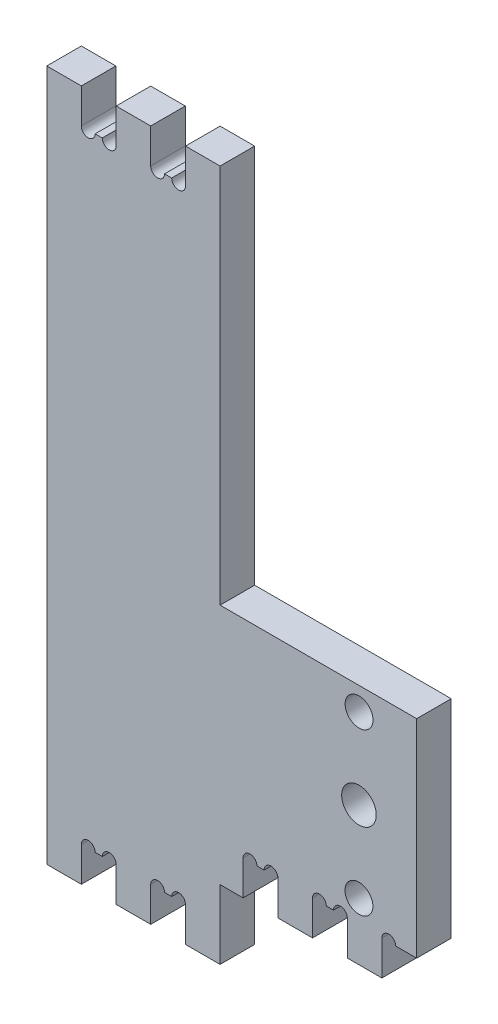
ISO-10303-21;
HEADER;
FILE_DESCRIPTION(('STEP AP214'),'2;1');
FILE_NAME('part.step','',(''),(''),'','','');
FILE_SCHEMA(('AUTOMOTIVE_DESIGN { 1 0 10303 214 1 1 1 1 }'));
ENDSEC;
DATA;
#1=APPLICATION_CONTEXT('core data for automotive mechanical design processes');
#2=APPLICATION_PROTOCOL_DEFINITION('international standard','automotive_design',2000,#1);
#3=PRODUCT_CONTEXT('',#1,'mechanical');
#4=PRODUCT('Part','Part','',(#3));
#5=PRODUCT_RELATED_PRODUCT_CATEGORY('part','',(#4));
#6=PRODUCT_DEFINITION_FORMATION('','',#4);
#7=PRODUCT_DEFINITION_CONTEXT('part definition',#1,'design');
#8=PRODUCT_DEFINITION('design','',#6,#7);
#9=PRODUCT_DEFINITION_SHAPE('','',#8);
#10=(LENGTH_UNIT() NAMED_UNIT(*) SI_UNIT(.MILLI.,.METRE.));
#11=(NAMED_UNIT(*) PLANE_ANGLE_UNIT() SI_UNIT($,.RADIAN.));
#12=(NAMED_UNIT(*) SI_UNIT($,.STERADIAN.) SOLID_ANGLE_UNIT());
#13=UNCERTAINTY_MEASURE_WITH_UNIT(LENGTH_MEASURE(1.E-05),#10,'distance_accuracy_value','');
#14=(GEOMETRIC_REPRESENTATION_CONTEXT(3) GLOBAL_UNCERTAINTY_ASSIGNED_CONTEXT((#13)) GLOBAL_UNIT_ASSIGNED_CONTEXT((#10,
#11,#12)) REPRESENTATION_CONTEXT('',''));
#15=CARTESIAN_POINT('',(0.,0.,0.));
#16=DIRECTION('',(0.,0.,1.));
#17=DIRECTION('',(1.,0.,0.));
#18=AXIS2_PLACEMENT_3D('',#15,#16,#17);
#19=CARTESIAN_POINT('',(14.7481827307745,-45.,15.));
#20=DIRECTION('',(0.,1.,0.));
#21=DIRECTION('',(0.,0.,1.));
#22=AXIS2_PLACEMENT_3D('',#19,#20,#21);
#23=PLANE('',#22);
#24=DIRECTION('',(1.,0.,0.));
#25=VECTOR('',#24,1.);
#26=CARTESIAN_POINT('',(14.7481827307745,-45.,0.));
#27=LINE('',#26,#25);
#28=CARTESIAN_POINT('',(-0.251817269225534,-45.,0.));
#29=VERTEX_POINT('',#28);
#30=CARTESIAN_POINT('',(14.7481827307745,-45.,0.));
#31=VERTEX_POINT('',#30);
#32=EDGE_CURVE('E387',#29,#31,#27,.T.);
#33=ORIENTED_EDGE('',*,*,#32,.T.);
#34=DIRECTION('',(0.,0.,-1.));
#35=VECTOR('',#34,1.);
#36=CARTESIAN_POINT('',(14.7481827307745,-45.,15.));
#37=LINE('',#36,#35);
#38=CARTESIAN_POINT('',(14.7481827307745,-45.,15.));
#39=VERTEX_POINT('',#38);
#40=EDGE_CURVE('E11',#39,#31,#37,.T.);
#41=ORIENTED_EDGE('',*,*,#40,.F.);
#42=DIRECTION('',(1.,0.,0.));
#43=VECTOR('',#42,1.);
#44=CARTESIAN_POINT('',(14.7481827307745,-45.,15.));
#45=LINE('',#44,#43);
#46=CARTESIAN_POINT('',(-0.251817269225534,-45.,15.));
#47=VERTEX_POINT('',#46);
#48=EDGE_CURVE('E492',#47,#39,#45,.T.);
#49=ORIENTED_EDGE('',*,*,#48,.F.);
#50=DIRECTION('',(0.,0.,-1.));
#51=VECTOR('',#50,1.);
#52=CARTESIAN_POINT('',(-0.251817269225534,-45.,15.));
#53=LINE('',#52,#51);
#54=EDGE_CURVE('E383',#47,#29,#53,.T.);
#55=ORIENTED_EDGE('',*,*,#54,.T.);
#56=EDGE_LOOP('',(#33,#41,#49,#55));
#57=FACE_BOUND('',#56,.T.);
#58=ADVANCED_FACE('F41',(#57),#23,.F.);
#59=CARTESIAN_POINT('',(14.7481827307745,-15.,15.));
#60=DIRECTION('',(-1.,0.,0.));
#61=DIRECTION('',(0.,-1.,0.));
#62=AXIS2_PLACEMENT_3D('',#59,#60,#61);
#63=PLANE('',#62);
#64=DIRECTION('',(0.,1.,0.));
#65=VECTOR('',#64,1.);
#66=CARTESIAN_POINT('',(14.7481827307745,-15.,0.));
#67=LINE('',#66,#65);
#68=CARTESIAN_POINT('',(14.7481827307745,-15.,0.));
#69=VERTEX_POINT('',#68);
#70=EDGE_CURVE('E390',#31,#69,#67,.T.);
#71=ORIENTED_EDGE('',*,*,#70,.T.);
#72=DIRECTION('',(0.,0.,-1.));
#73=VECTOR('',#72,1.);
#74=CARTESIAN_POINT('',(14.7481827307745,-15.,15.));
#75=LINE('',#74,#73);
#76=CARTESIAN_POINT('',(14.7481827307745,-15.,15.));
#77=VERTEX_POINT('',#76);
#78=EDGE_CURVE('E49',#77,#69,#75,.T.);
#79=ORIENTED_EDGE('',*,*,#78,.F.);
#80=DIRECTION('',(0.,1.,0.));
#81=VECTOR('',#80,1.);
#82=CARTESIAN_POINT('',(14.7481827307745,-40.,15.));
#83=LINE('',#82,#81);
#84=EDGE_CURVE('E225',#39,#77,#83,.T.);
#85=ORIENTED_EDGE('',*,*,#84,.F.);
#86=ORIENTED_EDGE('',*,*,#40,.T.);
#87=EDGE_LOOP('',(#71,#79,#85,#86));
#88=FACE_BOUND('',#87,.T.);
#89=ADVANCED_FACE('F764',(#88),#63,.F.);
#90=CARTESIAN_POINT('',(24.7481827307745,-15.,15.));
#91=DIRECTION('',(0.,1.,0.));
#92=DIRECTION('',(0.,0.,1.));
#93=AXIS2_PLACEMENT_3D('',#90,#91,#92);
#94=PLANE('',#93);
#95=DIRECTION('',(1.,0.,0.));
#96=VECTOR('',#95,1.);
#97=CARTESIAN_POINT('',(24.7481827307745,-15.,0.));
#98=LINE('',#97,#96);
#99=CARTESIAN_POINT('',(24.7481827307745,-15.,0.));
#100=VERTEX_POINT('',#99);
#101=EDGE_CURVE('E393',#69,#100,#98,.T.);
#102=ORIENTED_EDGE('',*,*,#101,.T.);
#103=DIRECTION('',(0.,0.,-1.));
#104=VECTOR('',#103,1.);
#105=CARTESIAN_POINT('',(24.7481827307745,-15.,15.));
#106=LINE('',#105,#104);
#107=CARTESIAN_POINT('',(24.7481827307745,-15.,15.));
#108=VERTEX_POINT('',#107);
#109=EDGE_CURVE('E624',#108,#100,#106,.T.);
#110=ORIENTED_EDGE('',*,*,#109,.F.);
#111=DIRECTION('',(1.,0.,0.));
#112=VECTOR('',#111,1.);
#113=CARTESIAN_POINT('',(24.7481827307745,-15.,15.));
#114=LINE('',#113,#112);
#115=EDGE_CURVE('E632',#77,#108,#114,.T.);
#116=ORIENTED_EDGE('',*,*,#115,.F.);
#117=ORIENTED_EDGE('',*,*,#78,.T.);
#118=EDGE_LOOP('',(#102,#110,#116,#117));
#119=FACE_BOUND('',#118,.T.);
#120=ADVANCED_FACE('F630',(#119),#94,.F.);
#121=CARTESIAN_POINT('',(24.7481827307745,0.,15.));
#122=DIRECTION('',(-1.,0.,0.));
#123=DIRECTION('',(0.,-1.,0.));
#124=AXIS2_PLACEMENT_3D('',#121,#122,#123);
#125=PLANE('',#124);
#126=DIRECTION('',(0.,1.,0.));
#127=VECTOR('',#126,1.);
#128=CARTESIAN_POINT('',(24.7481827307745,0.,0.));
#129=LINE('',#128,#127);
#130=CARTESIAN_POINT('',(24.7481827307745,0.,0.));
#131=VERTEX_POINT('',#130);
#132=EDGE_CURVE('E395',#100,#131,#129,.T.);
#133=ORIENTED_EDGE('',*,*,#132,.T.);
#134=DIRECTION('',(0.,0.,-1.));
#135=VECTOR('',#134,1.);
#136=CARTESIAN_POINT('',(24.7481827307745,0.,15.));
#137=LINE('',#136,#135);
#138=CARTESIAN_POINT('',(24.7481827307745,0.,15.));
#139=VERTEX_POINT('',#138);
#140=EDGE_CURVE('E621',#139,#131,#137,.T.);
#141=ORIENTED_EDGE('',*,*,#140,.F.);
#142=DIRECTION('',(0.,1.,0.));
#143=VECTOR('',#142,1.);
#144=CARTESIAN_POINT('',(24.7481827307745,0.,15.));
#145=LINE('',#144,#143);
#146=EDGE_CURVE('E650',#108,#139,#145,.T.);
#147=ORIENTED_EDGE('',*,*,#146,.F.);
#148=ORIENTED_EDGE('',*,*,#109,.T.);
#149=EDGE_LOOP('',(#133,#141,#147,#148));
#150=FACE_BOUND('',#149,.T.);
#151=ADVANCED_FACE('F641',(#150),#125,.F.);
#152=CARTESIAN_POINT('',(27.7481827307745,0.,15.));
#153=DIRECTION('',(0.,0.,-1.));
#154=DIRECTION('',(-1.,0.,0.));
#155=AXIS2_PLACEMENT_3D('',#152,#153,#154);
#156=CYLINDRICAL_SURFACE('',#155,3.);
#157=CARTESIAN_POINT('',(27.7481827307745,0.,0.));
#158=DIRECTION('',(0.,0.,-1.));
#159=DIRECTION('',(-1.,0.,0.));
#160=AXIS2_PLACEMENT_3D('',#157,#158,#159);
#161=CIRCLE('',#160,3.);
#162=CARTESIAN_POINT('',(30.7481827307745,0.,0.));
#163=VERTEX_POINT('',#162);
#164=EDGE_CURVE('E397',#131,#163,#161,.T.);
#165=ORIENTED_EDGE('',*,*,#164,.T.);
#166=DIRECTION('',(0.,0.,-1.));
#167=VECTOR('',#166,1.);
#168=CARTESIAN_POINT('',(30.7481827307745,0.,15.));
#169=LINE('',#168,#167);
#170=CARTESIAN_POINT('',(30.7481827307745,0.,15.));
#171=VERTEX_POINT('',#170);
#172=EDGE_CURVE('E618',#171,#163,#169,.T.);
#173=ORIENTED_EDGE('',*,*,#172,.F.);
#174=CARTESIAN_POINT('',(27.7481827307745,0.,15.));
#175=DIRECTION('',(0.,0.,-1.));
#176=DIRECTION('',(-1.,0.,0.));
#177=AXIS2_PLACEMENT_3D('',#174,#175,#176);
#178=CIRCLE('',#177,3.);
#179=EDGE_CURVE('E647',#139,#171,#178,.T.);
#180=ORIENTED_EDGE('',*,*,#179,.F.);
#181=ORIENTED_EDGE('',*,*,#140,.T.);
#182=EDGE_LOOP('',(#165,#173,#180,#181));
#183=FACE_BOUND('',#182,.T.);
#184=ADVANCED_FACE('F645',(#183),#156,.F.);
#185=CARTESIAN_POINT('',(33.8481827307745,0.,15.));
#186=DIRECTION('',(0.,1.,0.));
#187=DIRECTION('',(-1.,0.,0.));
#188=AXIS2_PLACEMENT_3D('',#185,#186,#187);
#189=PLANE('',#188);
#190=DIRECTION('',(1.,0.,0.));
#191=VECTOR('',#190,1.);
#192=CARTESIAN_POINT('',(33.8481827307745,0.,0.));
#193=LINE('',#192,#191);
#194=CARTESIAN_POINT('',(33.8481827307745,0.,0.));
#195=VERTEX_POINT('',#194);
#196=EDGE_CURVE('E399',#163,#195,#193,.T.);
#197=ORIENTED_EDGE('',*,*,#196,.T.);
#198=DIRECTION('',(0.,0.,-1.));
#199=VECTOR('',#198,1.);
#200=CARTESIAN_POINT('',(33.8481827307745,0.,15.));
#201=LINE('',#200,#199);
#202=CARTESIAN_POINT('',(33.8481827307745,0.,15.));
#203=VERTEX_POINT('',#202);
#204=EDGE_CURVE('E615',#203,#195,#201,.T.);
#205=ORIENTED_EDGE('',*,*,#204,.F.);
#206=DIRECTION('',(1.,0.,0.));
#207=VECTOR('',#206,1.);
#208=CARTESIAN_POINT('',(33.8481827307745,0.,15.));
#209=LINE('',#208,#207);
#210=EDGE_CURVE('E649',#171,#203,#209,.T.);
#211=ORIENTED_EDGE('',*,*,#210,.F.);
#212=ORIENTED_EDGE('',*,*,#172,.T.);
#213=EDGE_LOOP('',(#197,#205,#211,#212));
#214=FACE_BOUND('',#213,.T.);
#215=ADVANCED_FACE('F777',(#214),#189,.F.);
#216=CARTESIAN_POINT('',(36.8481827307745,0.,15.));
#217=DIRECTION('',(0.,0.,-1.));
#218=DIRECTION('',(-1.,0.,0.));
#219=AXIS2_PLACEMENT_3D('',#216,#217,#218);
#220=CYLINDRICAL_SURFACE('',#219,3.);
#221=CARTESIAN_POINT('',(36.8481827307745,0.,0.));
#222=DIRECTION('',(0.,0.,-1.));
#223=DIRECTION('',(-1.,0.,0.));
#224=AXIS2_PLACEMENT_3D('',#221,#222,#223);
#225=CIRCLE('',#224,3.);
#226=CARTESIAN_POINT('',(39.8481827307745,0.,0.));
#227=VERTEX_POINT('',#226);
#228=EDGE_CURVE('E401',#195,#227,#225,.T.);
#229=ORIENTED_EDGE('',*,*,#228,.T.);
#230=DIRECTION('',(0.,0.,-1.));
#231=VECTOR('',#230,1.);
#232=CARTESIAN_POINT('',(39.8481827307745,0.,15.));
#233=LINE('',#232,#231);
#234=CARTESIAN_POINT('',(39.8481827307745,0.,15.));
#235=VERTEX_POINT('',#234);
#236=EDGE_CURVE('E611',#235,#227,#233,.T.);
#237=ORIENTED_EDGE('',*,*,#236,.F.);
#238=CARTESIAN_POINT('',(36.8481827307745,0.,15.));
#239=DIRECTION('',(0.,0.,-1.));
#240=DIRECTION('',(-1.,0.,0.));
#241=AXIS2_PLACEMENT_3D('',#238,#239,#240);
#242=CIRCLE('',#241,3.);
#243=EDGE_CURVE('E652',#203,#235,#242,.T.);
#244=ORIENTED_EDGE('',*,*,#243,.F.);
#245=ORIENTED_EDGE('',*,*,#204,.T.);
#246=EDGE_LOOP('',(#229,#237,#244,#245));
#247=FACE_BOUND('',#246,.T.);
#248=ADVANCED_FACE('F780',(#247),#220,.F.);
#249=CARTESIAN_POINT('',(39.8481827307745,-15.,15.));
#250=DIRECTION('',(1.,0.,0.));
#251=DIRECTION('',(0.,1.,0.));
#252=AXIS2_PLACEMENT_3D('',#249,#250,#251);
#253=PLANE('',#252);
#254=DIRECTION('',(0.,-1.,0.));
#255=VECTOR('',#254,1.);
#256=CARTESIAN_POINT('',(39.8481827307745,-15.,0.));
#257=LINE('',#256,#255);
#258=CARTESIAN_POINT('',(39.8481827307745,-15.,0.));
#259=VERTEX_POINT('',#258);
#260=EDGE_CURVE('E404',#227,#259,#257,.T.);
#261=ORIENTED_EDGE('',*,*,#260,.T.);
#262=DIRECTION('',(0.,0.,-1.));
#263=VECTOR('',#262,1.);
#264=CARTESIAN_POINT('',(39.8481827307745,-15.,15.));
#265=LINE('',#264,#263);
#266=CARTESIAN_POINT('',(39.8481827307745,-15.,15.));
#267=VERTEX_POINT('',#266);
#268=EDGE_CURVE('E607',#267,#259,#265,.T.);
#269=ORIENTED_EDGE('',*,*,#268,.F.);
#270=DIRECTION('',(0.,-1.,0.));
#271=VECTOR('',#270,1.);
#272=CARTESIAN_POINT('',(39.8481827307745,-15.,15.));
#273=LINE('',#272,#271);
#274=EDGE_CURVE('E659',#235,#267,#273,.T.);
#275=ORIENTED_EDGE('',*,*,#274,.F.);
#276=ORIENTED_EDGE('',*,*,#236,.T.);
#277=EDGE_LOOP('',(#261,#269,#275,#276));
#278=FACE_BOUND('',#277,.T.);
#279=ADVANCED_FACE('F784',(#278),#253,.F.);
#280=CARTESIAN_POINT('',(54.8481827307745,-15.,15.));
#281=DIRECTION('',(0.,1.,0.));
#282=DIRECTION('',(0.,0.,1.));
#283=AXIS2_PLACEMENT_3D('',#280,#281,#282);
#284=PLANE('',#283);
#285=DIRECTION('',(1.,0.,0.));
#286=VECTOR('',#285,1.);
#287=CARTESIAN_POINT('',(54.8481827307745,-15.,0.));
#288=LINE('',#287,#286);
#289=CARTESIAN_POINT('',(54.8481827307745,-15.,0.));
#290=VERTEX_POINT('',#289);
#291=EDGE_CURVE('E407',#259,#290,#288,.T.);
#292=ORIENTED_EDGE('',*,*,#291,.T.);
#293=DIRECTION('',(0.,0.,-1.));
#294=VECTOR('',#293,1.);
#295=CARTESIAN_POINT('',(54.8481827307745,-15.,15.));
#296=LINE('',#295,#294);
#297=CARTESIAN_POINT('',(54.8481827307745,-15.,15.));
#298=VERTEX_POINT('',#297);
#299=EDGE_CURVE('E603',#298,#290,#296,.T.);
#300=ORIENTED_EDGE('',*,*,#299,.F.);
#301=DIRECTION('',(1.,0.,0.));
#302=VECTOR('',#301,1.);
#303=CARTESIAN_POINT('',(54.8481827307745,-15.,15.));
#304=LINE('',#303,#302);
#305=EDGE_CURVE('E662',#267,#298,#304,.T.);
#306=ORIENTED_EDGE('',*,*,#305,.F.);
#307=ORIENTED_EDGE('',*,*,#268,.T.);
#308=EDGE_LOOP('',(#292,#300,#306,#307));
#309=FACE_BOUND('',#308,.T.);
#310=ADVANCED_FACE('F788',(#309),#284,.F.);
#311=CARTESIAN_POINT('',(54.8481827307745,0.,15.));
#312=DIRECTION('',(-1.,0.,0.));
#313=DIRECTION('',(0.,0.,1.));
#314=AXIS2_PLACEMENT_3D('',#311,#312,#313);
#315=PLANE('',#314);
#316=DIRECTION('',(0.,1.,0.));
#317=VECTOR('',#316,1.);
#318=CARTESIAN_POINT('',(54.8481827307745,0.,0.));
#319=LINE('',#318,#317);
#320=CARTESIAN_POINT('',(54.8481827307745,0.,0.));
#321=VERTEX_POINT('',#320);
#322=EDGE_CURVE('E410',#290,#321,#319,.T.);
#323=ORIENTED_EDGE('',*,*,#322,.T.);
#324=DIRECTION('',(0.,0.,-1.));
#325=VECTOR('',#324,1.);
#326=CARTESIAN_POINT('',(54.8481827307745,0.,15.));
#327=LINE('',#326,#325);
#328=CARTESIAN_POINT('',(54.8481827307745,0.,15.));
#329=VERTEX_POINT('',#328);
#330=EDGE_CURVE('E599',#329,#321,#327,.T.);
#331=ORIENTED_EDGE('',*,*,#330,.F.);
#332=DIRECTION('',(0.,1.,0.));
#333=VECTOR('',#332,1.);
#334=CARTESIAN_POINT('',(54.8481827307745,0.,15.));
#335=LINE('',#334,#333);
#336=EDGE_CURVE('E665',#298,#329,#335,.T.);
#337=ORIENTED_EDGE('',*,*,#336,.F.);
#338=ORIENTED_EDGE('',*,*,#299,.T.);
#339=EDGE_LOOP('',(#323,#331,#337,#338));
#340=FACE_BOUND('',#339,.T.);
#341=ADVANCED_FACE('F792',(#340),#315,.F.);
#342=CARTESIAN_POINT('',(57.8481827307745,0.,15.));
#343=DIRECTION('',(0.,0.,-1.));
#344=DIRECTION('',(-1.,0.,0.));
#345=AXIS2_PLACEMENT_3D('',#342,#343,#344);
#346=CYLINDRICAL_SURFACE('',#345,3.);
#347=CARTESIAN_POINT('',(57.8481827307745,0.,0.));
#348=DIRECTION('',(0.,0.,-1.));
#349=DIRECTION('',(-1.,0.,0.));
#350=AXIS2_PLACEMENT_3D('',#347,#348,#349);
#351=CIRCLE('',#350,3.);
#352=CARTESIAN_POINT('',(60.8481827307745,0.,0.));
#353=VERTEX_POINT('',#352);
#354=EDGE_CURVE('E413',#321,#353,#351,.T.);
#355=ORIENTED_EDGE('',*,*,#354,.T.);
#356=DIRECTION('',(0.,0.,-1.));
#357=VECTOR('',#356,1.);
#358=CARTESIAN_POINT('',(60.8481827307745,0.,15.));
#359=LINE('',#358,#357);
#360=CARTESIAN_POINT('',(60.8481827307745,0.,15.));
#361=VERTEX_POINT('',#360);
#362=EDGE_CURVE('E595',#361,#353,#359,.T.);
#363=ORIENTED_EDGE('',*,*,#362,.F.);
#364=CARTESIAN_POINT('',(57.8481827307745,0.,15.));
#365=DIRECTION('',(0.,0.,-1.));
#366=DIRECTION('',(-1.,0.,0.));
#367=AXIS2_PLACEMENT_3D('',#364,#365,#366);
#368=CIRCLE('',#367,3.);
#369=EDGE_CURVE('E668',#329,#361,#368,.T.);
#370=ORIENTED_EDGE('',*,*,#369,.F.);
#371=ORIENTED_EDGE('',*,*,#330,.T.);
#372=EDGE_LOOP('',(#355,#363,#370,#371));
#373=FACE_BOUND('',#372,.T.);
#374=ADVANCED_FACE('F796',(#373),#346,.F.);
#375=CARTESIAN_POINT('',(63.9481827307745,0.,15.));
#376=DIRECTION('',(0.,1.,0.));
#377=DIRECTION('',(-1.,0.,0.));
#378=AXIS2_PLACEMENT_3D('',#375,#376,#377);
#379=PLANE('',#378);
#380=DIRECTION('',(1.,0.,0.));
#381=VECTOR('',#380,1.);
#382=CARTESIAN_POINT('',(63.9481827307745,0.,0.));
#383=LINE('',#382,#381);
#384=CARTESIAN_POINT('',(63.9481827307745,0.,0.));
#385=VERTEX_POINT('',#384);
#386=EDGE_CURVE('E416',#353,#385,#383,.T.);
#387=ORIENTED_EDGE('',*,*,#386,.T.);
#388=DIRECTION('',(0.,0.,-1.));
#389=VECTOR('',#388,1.);
#390=CARTESIAN_POINT('',(63.9481827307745,0.,15.));
#391=LINE('',#390,#389);
#392=CARTESIAN_POINT('',(63.9481827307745,0.,15.));
#393=VERTEX_POINT('',#392);
#394=EDGE_CURVE('E591',#393,#385,#391,.T.);
#395=ORIENTED_EDGE('',*,*,#394,.F.);
#396=DIRECTION('',(1.,0.,0.));
#397=VECTOR('',#396,1.);
#398=CARTESIAN_POINT('',(63.9481827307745,0.,15.));
#399=LINE('',#398,#397);
#400=EDGE_CURVE('E671',#361,#393,#399,.T.);
#401=ORIENTED_EDGE('',*,*,#400,.F.);
#402=ORIENTED_EDGE('',*,*,#362,.T.);
#403=EDGE_LOOP('',(#387,#395,#401,#402));
#404=FACE_BOUND('',#403,.T.);
#405=ADVANCED_FACE('F800',(#404),#379,.F.);
#406=CARTESIAN_POINT('',(66.9481827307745,0.,15.));
#407=DIRECTION('',(0.,0.,-1.));
#408=DIRECTION('',(-1.,0.,0.));
#409=AXIS2_PLACEMENT_3D('',#406,#407,#408);
#410=CYLINDRICAL_SURFACE('',#409,3.);
#411=CARTESIAN_POINT('',(66.9481827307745,0.,0.));
#412=DIRECTION('',(0.,0.,-1.));
#413=DIRECTION('',(-1.,0.,0.));
#414=AXIS2_PLACEMENT_3D('',#411,#412,#413);
#415=CIRCLE('',#414,3.);
#416=CARTESIAN_POINT('',(69.9481827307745,0.,0.));
#417=VERTEX_POINT('',#416);
#418=EDGE_CURVE('E419',#385,#417,#415,.T.);
#419=ORIENTED_EDGE('',*,*,#418,.T.);
#420=DIRECTION('',(0.,0.,-1.));
#421=VECTOR('',#420,1.);
#422=CARTESIAN_POINT('',(69.9481827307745,0.,15.));
#423=LINE('',#422,#421);
#424=CARTESIAN_POINT('',(69.9481827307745,0.,15.));
#425=VERTEX_POINT('',#424);
#426=EDGE_CURVE('E587',#425,#417,#423,.T.);
#427=ORIENTED_EDGE('',*,*,#426,.F.);
#428=CARTESIAN_POINT('',(66.9481827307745,0.,15.));
#429=DIRECTION('',(0.,0.,-1.));
#430=DIRECTION('',(-1.,0.,0.));
#431=AXIS2_PLACEMENT_3D('',#428,#429,#430);
#432=CIRCLE('',#431,3.);
#433=EDGE_CURVE('E674',#393,#425,#432,.T.);
#434=ORIENTED_EDGE('',*,*,#433,.F.);
#435=ORIENTED_EDGE('',*,*,#394,.T.);
#436=EDGE_LOOP('',(#419,#427,#434,#435));
#437=FACE_BOUND('',#436,.T.);
#438=ADVANCED_FACE('F804',(#437),#410,.F.);
#439=CARTESIAN_POINT('',(69.9481827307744,-15.,15.));
#440=DIRECTION('',(1.,0.,0.));
#441=DIRECTION('',(0.,1.,0.));
#442=AXIS2_PLACEMENT_3D('',#439,#440,#441);
#443=PLANE('',#442);
#444=DIRECTION('',(0.,-1.,0.));
#445=VECTOR('',#444,1.);
#446=CARTESIAN_POINT('',(69.9481827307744,-15.,0.));
#447=LINE('',#446,#445);
#448=CARTESIAN_POINT('',(69.9481827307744,-15.,0.));
#449=VERTEX_POINT('',#448);
#450=EDGE_CURVE('E422',#417,#449,#447,.T.);
#451=ORIENTED_EDGE('',*,*,#450,.T.);
#452=DIRECTION('',(0.,0.,-1.));
#453=VECTOR('',#452,1.);
#454=CARTESIAN_POINT('',(69.9481827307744,-15.,15.));
#455=LINE('',#454,#453);
#456=CARTESIAN_POINT('',(69.9481827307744,-15.,15.));
#457=VERTEX_POINT('',#456);
#458=EDGE_CURVE('E583',#457,#449,#455,.T.);
#459=ORIENTED_EDGE('',*,*,#458,.F.);
#460=DIRECTION('',(0.,-1.,0.));
#461=VECTOR('',#460,1.);
#462=CARTESIAN_POINT('',(69.9481827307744,-15.,15.));
#463=LINE('',#462,#461);
#464=EDGE_CURVE('E677',#425,#457,#463,.T.);
#465=ORIENTED_EDGE('',*,*,#464,.F.);
#466=ORIENTED_EDGE('',*,*,#426,.T.);
#467=EDGE_LOOP('',(#451,#459,#465,#466));
#468=FACE_BOUND('',#467,.T.);
#469=ADVANCED_FACE('F808',(#468),#443,.F.);
#470=CARTESIAN_POINT('',(84.9481827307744,-15.,15.));
#471=DIRECTION('',(0.,1.,0.));
#472=DIRECTION('',(-1.,0.,0.));
#473=AXIS2_PLACEMENT_3D('',#470,#471,#472);
#474=PLANE('',#473);
#475=DIRECTION('',(1.,0.,0.));
#476=VECTOR('',#475,1.);
#477=CARTESIAN_POINT('',(84.9481827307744,-15.,0.));
#478=LINE('',#477,#476);
#479=CARTESIAN_POINT('',(84.9481827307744,-15.,0.));
#480=VERTEX_POINT('',#479);
#481=EDGE_CURVE('E425',#449,#480,#478,.T.);
#482=ORIENTED_EDGE('',*,*,#481,.T.);
#483=DIRECTION('',(0.,0.,-1.));
#484=VECTOR('',#483,1.);
#485=CARTESIAN_POINT('',(84.9481827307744,-15.,15.));
#486=LINE('',#485,#484);
#487=CARTESIAN_POINT('',(84.9481827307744,-15.,15.));
#488=VERTEX_POINT('',#487);
#489=EDGE_CURVE('E580',#488,#480,#486,.T.);
#490=ORIENTED_EDGE('',*,*,#489,.F.);
#491=DIRECTION('',(1.,0.,0.));
#492=VECTOR('',#491,1.);
#493=CARTESIAN_POINT('',(84.9481827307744,-15.,15.));
#494=LINE('',#493,#492);
#495=EDGE_CURVE('E680',#457,#488,#494,.T.);
#496=ORIENTED_EDGE('',*,*,#495,.F.);
#497=ORIENTED_EDGE('',*,*,#458,.T.);
#498=EDGE_LOOP('',(#482,#490,#496,#497));
#499=FACE_BOUND('',#498,.T.);
#500=ADVANCED_FACE('F812',(#499),#474,.F.);
#501=CARTESIAN_POINT('',(84.9481827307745,0.,15.));
#502=DIRECTION('',(-1.,0.,0.));
#503=DIRECTION('',(0.,-1.,0.));
#504=AXIS2_PLACEMENT_3D('',#501,#502,#503);
#505=PLANE('',#504);
#506=DIRECTION('',(0.,1.,0.));
#507=VECTOR('',#506,1.);
#508=CARTESIAN_POINT('',(84.9481827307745,0.,0.));
#509=LINE('',#508,#507);
#510=CARTESIAN_POINT('',(84.9481827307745,0.,0.));
#511=VERTEX_POINT('',#510);
#512=EDGE_CURVE('E428',#480,#511,#509,.T.);
#513=ORIENTED_EDGE('',*,*,#512,.T.);
#514=DIRECTION('',(0.,0.,-1.));
#515=VECTOR('',#514,1.);
#516=CARTESIAN_POINT('',(84.9481827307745,0.,15.));
#517=LINE('',#516,#515);
#518=CARTESIAN_POINT('',(84.9481827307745,0.,15.));
#519=VERTEX_POINT('',#518);
#520=EDGE_CURVE('E577',#519,#511,#517,.T.);
#521=ORIENTED_EDGE('',*,*,#520,.F.);
#522=DIRECTION('',(0.,1.,0.));
#523=VECTOR('',#522,1.);
#524=CARTESIAN_POINT('',(84.9481827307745,0.,15.));
#525=LINE('',#524,#523);
#526=EDGE_CURVE('E683',#488,#519,#525,.T.);
#527=ORIENTED_EDGE('',*,*,#526,.F.);
#528=ORIENTED_EDGE('',*,*,#489,.T.);
#529=EDGE_LOOP('',(#513,#521,#527,#528));
#530=FACE_BOUND('',#529,.T.);
#531=ADVANCED_FACE('F816',(#530),#505,.F.);
#532=CARTESIAN_POINT('',(87.9481827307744,0.,15.));
#533=DIRECTION('',(0.,0.,-1.));
#534=DIRECTION('',(-1.,0.,0.));
#535=AXIS2_PLACEMENT_3D('',#532,#533,#534);
#536=CYLINDRICAL_SURFACE('',#535,2.99999999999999);
#537=CARTESIAN_POINT('',(87.9481827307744,0.,0.));
#538=DIRECTION('',(0.,0.,-1.));
#539=DIRECTION('',(1.,0.,0.));
#540=AXIS2_PLACEMENT_3D('',#537,#538,#539);
#541=CIRCLE('',#540,2.99999999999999);
#542=CARTESIAN_POINT('',(90.9481827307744,0.,0.));
#543=VERTEX_POINT('',#542);
#544=EDGE_CURVE('E430',#511,#543,#541,.T.);
#545=ORIENTED_EDGE('',*,*,#544,.T.);
#546=DIRECTION('',(0.,0.,-1.));
#547=VECTOR('',#546,1.);
#548=CARTESIAN_POINT('',(90.9481827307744,0.,15.));
#549=LINE('',#548,#547);
#550=CARTESIAN_POINT('',(90.9481827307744,0.,15.));
#551=VERTEX_POINT('',#550);
#552=EDGE_CURVE('E574',#551,#543,#549,.T.);
#553=ORIENTED_EDGE('',*,*,#552,.F.);
#554=CARTESIAN_POINT('',(87.9481827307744,0.,15.));
#555=DIRECTION('',(0.,0.,-1.));
#556=DIRECTION('',(1.,0.,0.));
#557=AXIS2_PLACEMENT_3D('',#554,#555,#556);
#558=CIRCLE('',#557,2.99999999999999);
#559=EDGE_CURVE('E685',#519,#551,#558,.T.);
#560=ORIENTED_EDGE('',*,*,#559,.F.);
#561=ORIENTED_EDGE('',*,*,#520,.T.);
#562=EDGE_LOOP('',(#545,#553,#560,#561));
#563=FACE_BOUND('',#562,.T.);
#564=ADVANCED_FACE('F820',(#563),#536,.F.);
#565=CARTESIAN_POINT('',(100.048182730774,0.,15.));
#566=DIRECTION('',(0.,1.,0.));
#567=DIRECTION('',(-1.,0.,0.));
#568=AXIS2_PLACEMENT_3D('',#565,#566,#567);
#569=PLANE('',#568);
#570=DIRECTION('',(1.,0.,0.));
#571=VECTOR('',#570,1.);
#572=CARTESIAN_POINT('',(100.048182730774,0.,0.));
#573=LINE('',#572,#571);
#574=CARTESIAN_POINT('',(100.048182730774,0.,0.));
#575=VERTEX_POINT('',#574);
#576=EDGE_CURVE('E432',#543,#575,#573,.T.);
#577=ORIENTED_EDGE('',*,*,#576,.T.);
#578=DIRECTION('',(0.,0.,-1.));
#579=VECTOR('',#578,1.);
#580=CARTESIAN_POINT('',(100.048182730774,0.,15.));
#581=LINE('',#580,#579);
#582=CARTESIAN_POINT('',(100.048182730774,0.,15.));
#583=VERTEX_POINT('',#582);
#584=EDGE_CURVE('E571',#583,#575,#581,.T.);
#585=ORIENTED_EDGE('',*,*,#584,.F.);
#586=DIRECTION('',(1.,0.,0.));
#587=VECTOR('',#586,1.);
#588=CARTESIAN_POINT('',(100.048182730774,0.,15.));
#589=LINE('',#588,#587);
#590=EDGE_CURVE('E687',#551,#583,#589,.T.);
#591=ORIENTED_EDGE('',*,*,#590,.F.);
#592=ORIENTED_EDGE('',*,*,#552,.T.);
#593=EDGE_LOOP('',(#577,#585,#591,#592));
#594=FACE_BOUND('',#593,.T.);
#595=ADVANCED_FACE('F824',(#594),#569,.F.);
#596=CARTESIAN_POINT('',(100.048182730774,90.,15.));
#597=DIRECTION('',(-1.,0.,0.));
#598=DIRECTION('',(0.,0.,1.));
#599=AXIS2_PLACEMENT_3D('',#596,#597,#598);
#600=PLANE('',#599);
#601=DIRECTION('',(0.,1.,0.));
#602=VECTOR('',#601,1.);
#603=CARTESIAN_POINT('',(100.048182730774,90.,0.));
#604=LINE('',#603,#602);
#605=CARTESIAN_POINT('',(100.048182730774,90.,0.));
#606=VERTEX_POINT('',#605);
#607=EDGE_CURVE('E434',#575,#606,#604,.T.);
#608=ORIENTED_EDGE('',*,*,#607,.T.);
#609=DIRECTION('',(0.,0.,-1.));
#610=VECTOR('',#609,1.);
#611=CARTESIAN_POINT('',(100.048182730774,90.,15.));
#612=LINE('',#611,#610);
#613=CARTESIAN_POINT('',(100.048182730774,90.,15.));
#614=VERTEX_POINT('',#613);
#615=EDGE_CURVE('E568',#614,#606,#612,.T.);
#616=ORIENTED_EDGE('',*,*,#615,.F.);
#617=DIRECTION('',(0.,1.,0.));
#618=VECTOR('',#617,1.);
#619=CARTESIAN_POINT('',(100.048182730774,90.,15.));
#620=LINE('',#619,#618);
#621=EDGE_CURVE('E689',#583,#614,#620,.T.);
#622=ORIENTED_EDGE('',*,*,#621,.F.);
#623=ORIENTED_EDGE('',*,*,#584,.T.);
#624=EDGE_LOOP('',(#608,#616,#622,#623));
#625=FACE_BOUND('',#624,.T.);
#626=ADVANCED_FACE('F828',(#625),#600,.F.);
#627=CARTESIAN_POINT('',(14.7481827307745,90.,15.));
#628=DIRECTION('',(0.,-1.,0.));
#629=DIRECTION('',(0.,0.,-1.));
#630=AXIS2_PLACEMENT_3D('',#627,#628,#629);
#631=PLANE('',#630);
#632=DIRECTION('',(-1.,0.,0.));
#633=VECTOR('',#632,1.);
#634=CARTESIAN_POINT('',(14.7481827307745,90.,0.));
#635=LINE('',#634,#633);
#636=CARTESIAN_POINT('',(14.7481827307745,90.,0.));
#637=VERTEX_POINT('',#636);
#638=EDGE_CURVE('E436',#606,#637,#635,.T.);
#639=ORIENTED_EDGE('',*,*,#638,.T.);
#640=DIRECTION('',(0.,0.,-1.));
#641=VECTOR('',#640,1.);
#642=CARTESIAN_POINT('',(14.7481827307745,90.,15.));
#643=LINE('',#642,#641);
#644=CARTESIAN_POINT('',(14.7481827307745,90.,15.));
#645=VERTEX_POINT('',#644);
#646=EDGE_CURVE('E565',#645,#637,#643,.T.);
#647=ORIENTED_EDGE('',*,*,#646,.F.);
#648=DIRECTION('',(-1.,0.,0.));
#649=VECTOR('',#648,1.);
#650=CARTESIAN_POINT('',(14.7481827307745,90.,15.));
#651=LINE('',#650,#649);
#652=EDGE_CURVE('E691',#614,#645,#651,.T.);
#653=ORIENTED_EDGE('',*,*,#652,.F.);
#654=ORIENTED_EDGE('',*,*,#615,.T.);
#655=EDGE_LOOP('',(#639,#647,#653,#654));
#656=FACE_BOUND('',#655,.T.);
#657=ADVANCED_FACE('F832',(#656),#631,.F.);
#658=CARTESIAN_POINT('',(14.7481827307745,255.,15.));
#659=DIRECTION('',(-1.,0.,0.));
#660=DIRECTION('',(0.,-1.,0.));
#661=AXIS2_PLACEMENT_3D('',#658,#659,#660);
#662=PLANE('',#661);
#663=DIRECTION('',(0.,1.,0.));
#664=VECTOR('',#663,1.);
#665=CARTESIAN_POINT('',(14.7481827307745,255.,0.));
#666=LINE('',#665,#664);
#667=CARTESIAN_POINT('',(14.7481827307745,255.,0.));
#668=VERTEX_POINT('',#667);
#669=EDGE_CURVE('E439',#637,#668,#666,.T.);
#670=ORIENTED_EDGE('',*,*,#669,.T.);
#671=DIRECTION('',(0.,0.,-1.));
#672=VECTOR('',#671,1.);
#673=CARTESIAN_POINT('',(14.7481827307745,255.,15.));
#674=LINE('',#673,#672);
#675=CARTESIAN_POINT('',(14.7481827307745,255.,15.));
#676=VERTEX_POINT('',#675);
#677=EDGE_CURVE('E562',#676,#668,#674,.T.);
#678=ORIENTED_EDGE('',*,*,#677,.F.);
#679=DIRECTION('',(0.,1.,0.));
#680=VECTOR('',#679,1.);
#681=CARTESIAN_POINT('',(14.7481827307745,240.,15.));
#682=LINE('',#681,#680);
#683=EDGE_CURVE('E693',#645,#676,#682,.T.);
#684=ORIENTED_EDGE('',*,*,#683,.F.);
#685=ORIENTED_EDGE('',*,*,#646,.T.);
#686=EDGE_LOOP('',(#670,#678,#684,#685));
#687=FACE_BOUND('',#686,.T.);
#688=ADVANCED_FACE('F836',(#687),#662,.F.);
#689=CARTESIAN_POINT('',(-0.251817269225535,255.,15.));
#690=DIRECTION('',(0.,-1.,0.));
#691=DIRECTION('',(0.,0.,-1.));
#692=AXIS2_PLACEMENT_3D('',#689,#690,#691);
#693=PLANE('',#692);
#694=DIRECTION('',(-1.,0.,0.));
#695=VECTOR('',#694,1.);
#696=CARTESIAN_POINT('',(-0.251817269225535,255.,0.));
#697=LINE('',#696,#695);
#698=CARTESIAN_POINT('',(-0.251817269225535,255.,0.));
#699=VERTEX_POINT('',#698);
#700=EDGE_CURVE('E442',#668,#699,#697,.T.);
#701=ORIENTED_EDGE('',*,*,#700,.T.);
#702=DIRECTION('',(0.,0.,-1.));
#703=VECTOR('',#702,1.);
#704=CARTESIAN_POINT('',(-0.251817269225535,255.,15.));
#705=LINE('',#704,#703);
#706=CARTESIAN_POINT('',(-0.251817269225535,255.,15.));
#707=VERTEX_POINT('',#706);
#708=EDGE_CURVE('E559',#707,#699,#705,.T.);
#709=ORIENTED_EDGE('',*,*,#708,.F.);
#710=DIRECTION('',(-1.,0.,0.));
#711=VECTOR('',#710,1.);
#712=CARTESIAN_POINT('',(-0.251817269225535,255.,15.));
#713=LINE('',#712,#711);
#714=EDGE_CURVE('E696',#676,#707,#713,.T.);
#715=ORIENTED_EDGE('',*,*,#714,.F.);
#716=ORIENTED_EDGE('',*,*,#677,.T.);
#717=EDGE_LOOP('',(#701,#709,#715,#716));
#718=FACE_BOUND('',#717,.T.);
#719=ADVANCED_FACE('F840',(#718),#693,.F.);
#720=CARTESIAN_POINT('',(-0.251817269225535,240.,15.));
#721=DIRECTION('',(1.,0.,0.));
#722=DIRECTION('',(0.,1.,0.));
#723=AXIS2_PLACEMENT_3D('',#720,#721,#722);
#724=PLANE('',#723);
#725=DIRECTION('',(0.,-1.,0.));
#726=VECTOR('',#725,1.);
#727=CARTESIAN_POINT('',(-0.251817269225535,240.,0.));
#728=LINE('',#727,#726);
#729=CARTESIAN_POINT('',(-0.251817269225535,240.,0.));
#730=VERTEX_POINT('',#729);
#731=EDGE_CURVE('E444',#699,#730,#728,.T.);
#732=ORIENTED_EDGE('',*,*,#731,.T.);
#733=DIRECTION('',(0.,0.,-1.));
#734=VECTOR('',#733,1.);
#735=CARTESIAN_POINT('',(-0.251817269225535,240.,15.));
#736=LINE('',#735,#734);
#737=CARTESIAN_POINT('',(-0.251817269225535,240.,15.));
#738=VERTEX_POINT('',#737);
#739=EDGE_CURVE('E556',#738,#730,#736,.T.);
#740=ORIENTED_EDGE('',*,*,#739,.F.);
#741=DIRECTION('',(0.,-1.,0.));
#742=VECTOR('',#741,1.);
#743=CARTESIAN_POINT('',(-0.251817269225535,240.,15.));
#744=LINE('',#743,#742);
#745=EDGE_CURVE('E698',#707,#738,#744,.T.);
#746=ORIENTED_EDGE('',*,*,#745,.F.);
#747=ORIENTED_EDGE('',*,*,#708,.T.);
#748=EDGE_LOOP('',(#732,#740,#746,#747));
#749=FACE_BOUND('',#748,.T.);
#750=ADVANCED_FACE('F844',(#749),#724,.F.);
#751=CARTESIAN_POINT('',(-3.25181726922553,240.,15.));
#752=DIRECTION('',(0.,0.,-1.));
#753=DIRECTION('',(-1.,0.,0.));
#754=AXIS2_PLACEMENT_3D('',#751,#752,#753);
#755=CYLINDRICAL_SURFACE('',#754,3.);
#756=CARTESIAN_POINT('',(-3.25181726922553,240.,0.));
#757=DIRECTION('',(0.,0.,-1.));
#758=DIRECTION('',(1.,0.,0.));
#759=AXIS2_PLACEMENT_3D('',#756,#757,#758);
#760=CIRCLE('',#759,3.);
#761=CARTESIAN_POINT('',(-6.25181726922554,239.999999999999,0.));
#762=VERTEX_POINT('',#761);
#763=EDGE_CURVE('E446',#730,#762,#760,.T.);
#764=ORIENTED_EDGE('',*,*,#763,.T.);
#765=DIRECTION('',(0.,0.,-1.));
#766=VECTOR('',#765,1.);
#767=CARTESIAN_POINT('',(-6.25181726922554,239.999999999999,15.));
#768=LINE('',#767,#766);
#769=CARTESIAN_POINT('',(-6.25181726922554,239.999999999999,15.));
#770=VERTEX_POINT('',#769);
#771=EDGE_CURVE('E553',#770,#762,#768,.T.);
#772=ORIENTED_EDGE('',*,*,#771,.F.);
#773=CARTESIAN_POINT('',(-3.25181726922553,240.,15.));
#774=DIRECTION('',(0.,0.,-1.));
#775=DIRECTION('',(1.,0.,0.));
#776=AXIS2_PLACEMENT_3D('',#773,#774,#775);
#777=CIRCLE('',#776,3.);
#778=EDGE_CURVE('E700',#738,#770,#777,.T.);
#779=ORIENTED_EDGE('',*,*,#778,.F.);
#780=ORIENTED_EDGE('',*,*,#739,.T.);
#781=EDGE_LOOP('',(#764,#772,#779,#780));
#782=FACE_BOUND('',#781,.T.);
#783=ADVANCED_FACE('F848',(#782),#755,.F.);
#784=CARTESIAN_POINT('',(-9.35181726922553,239.999999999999,15.));
#785=DIRECTION('',(0.,-1.,0.));
#786=DIRECTION('',(0.,0.,-1.));
#787=AXIS2_PLACEMENT_3D('',#784,#785,#786);
#788=PLANE('',#787);
#789=DIRECTION('',(-1.,0.,0.));
#790=VECTOR('',#789,1.);
#791=CARTESIAN_POINT('',(-9.35181726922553,239.999999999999,0.));
#792=LINE('',#791,#790);
#793=CARTESIAN_POINT('',(-9.35181726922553,239.999999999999,0.));
#794=VERTEX_POINT('',#793);
#795=EDGE_CURVE('E448',#762,#794,#792,.T.);
#796=ORIENTED_EDGE('',*,*,#795,.T.);
#797=DIRECTION('',(0.,0.,-1.));
#798=VECTOR('',#797,1.);
#799=CARTESIAN_POINT('',(-9.35181726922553,239.999999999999,15.));
#800=LINE('',#799,#798);
#801=CARTESIAN_POINT('',(-9.35181726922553,239.999999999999,15.));
#802=VERTEX_POINT('',#801);
#803=EDGE_CURVE('E550',#802,#794,#800,.T.);
#804=ORIENTED_EDGE('',*,*,#803,.F.);
#805=DIRECTION('',(-1.,0.,0.));
#806=VECTOR('',#805,1.);
#807=CARTESIAN_POINT('',(-9.35181726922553,239.999999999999,15.));
#808=LINE('',#807,#806);
#809=EDGE_CURVE('E702',#770,#802,#808,.T.);
#810=ORIENTED_EDGE('',*,*,#809,.F.);
#811=ORIENTED_EDGE('',*,*,#771,.T.);
#812=EDGE_LOOP('',(#796,#804,#810,#811));
#813=FACE_BOUND('',#812,.T.);
#814=ADVANCED_FACE('F852',(#813),#788,.F.);
#815=CARTESIAN_POINT('',(-12.3518172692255,239.999999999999,15.));
#816=DIRECTION('',(0.,0.,-1.));
#817=DIRECTION('',(-1.,0.,0.));
#818=AXIS2_PLACEMENT_3D('',#815,#816,#817);
#819=CYLINDRICAL_SURFACE('',#818,3.);
#820=CARTESIAN_POINT('',(-12.3518172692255,239.999999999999,0.));
#821=DIRECTION('',(0.,0.,-1.));
#822=DIRECTION('',(1.,0.,0.));
#823=AXIS2_PLACEMENT_3D('',#820,#821,#822);
#824=CIRCLE('',#823,3.);
#825=CARTESIAN_POINT('',(-15.3518172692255,239.999999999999,0.));
#826=VERTEX_POINT('',#825);
#827=EDGE_CURVE('E450',#794,#826,#824,.T.);
#828=ORIENTED_EDGE('',*,*,#827,.T.);
#829=DIRECTION('',(0.,0.,-1.));
#830=VECTOR('',#829,1.);
#831=CARTESIAN_POINT('',(-15.3518172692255,239.999999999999,15.));
#832=LINE('',#831,#830);
#833=CARTESIAN_POINT('',(-15.3518172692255,239.999999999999,15.));
#834=VERTEX_POINT('',#833);
#835=EDGE_CURVE('E547',#834,#826,#832,.T.);
#836=ORIENTED_EDGE('',*,*,#835,.F.);
#837=CARTESIAN_POINT('',(-12.3518172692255,239.999999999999,15.));
#838=DIRECTION('',(0.,0.,-1.));
#839=DIRECTION('',(1.,0.,0.));
#840=AXIS2_PLACEMENT_3D('',#837,#838,#839);
#841=CIRCLE('',#840,3.);
#842=EDGE_CURVE('E704',#802,#834,#841,.T.);
#843=ORIENTED_EDGE('',*,*,#842,.F.);
#844=ORIENTED_EDGE('',*,*,#803,.T.);
#845=EDGE_LOOP('',(#828,#836,#843,#844));
#846=FACE_BOUND('',#845,.T.);
#847=ADVANCED_FACE('F856',(#846),#819,.F.);
#848=CARTESIAN_POINT('',(-15.3518172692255,255.,15.));
#849=DIRECTION('',(-1.,0.,0.));
#850=DIRECTION('',(0.,0.,1.));
#851=AXIS2_PLACEMENT_3D('',#848,#849,#850);
#852=PLANE('',#851);
#853=DIRECTION('',(0.,1.,0.));
#854=VECTOR('',#853,1.);
#855=CARTESIAN_POINT('',(-15.3518172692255,255.,0.));
#856=LINE('',#855,#854);
#857=CARTESIAN_POINT('',(-15.3518172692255,255.,0.));
#858=VERTEX_POINT('',#857);
#859=EDGE_CURVE('E452',#826,#858,#856,.T.);
#860=ORIENTED_EDGE('',*,*,#859,.T.);
#861=DIRECTION('',(0.,0.,-1.));
#862=VECTOR('',#861,1.);
#863=CARTESIAN_POINT('',(-15.3518172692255,255.,15.));
#864=LINE('',#863,#862);
#865=CARTESIAN_POINT('',(-15.3518172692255,255.,15.));
#866=VERTEX_POINT('',#865);
#867=EDGE_CURVE('E544',#866,#858,#864,.T.);
#868=ORIENTED_EDGE('',*,*,#867,.F.);
#869=DIRECTION('',(0.,1.,0.));
#870=VECTOR('',#869,1.);
#871=CARTESIAN_POINT('',(-15.3518172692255,255.,15.));
#872=LINE('',#871,#870);
#873=EDGE_CURVE('E706',#834,#866,#872,.T.);
#874=ORIENTED_EDGE('',*,*,#873,.F.);
#875=ORIENTED_EDGE('',*,*,#835,.T.);
#876=EDGE_LOOP('',(#860,#868,#874,#875));
#877=FACE_BOUND('',#876,.T.);
#878=ADVANCED_FACE('F860',(#877),#852,.F.);
#879=CARTESIAN_POINT('',(-30.3518172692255,255.,15.));
#880=DIRECTION('',(0.,-1.,0.));
#881=DIRECTION('',(0.,0.,-1.));
#882=AXIS2_PLACEMENT_3D('',#879,#880,#881);
#883=PLANE('',#882);
#884=DIRECTION('',(-1.,0.,0.));
#885=VECTOR('',#884,1.);
#886=CARTESIAN_POINT('',(-30.3518172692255,255.,0.));
#887=LINE('',#886,#885);
#888=CARTESIAN_POINT('',(-30.3518172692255,255.,0.));
#889=VERTEX_POINT('',#888);
#890=EDGE_CURVE('E454',#858,#889,#887,.T.);
#891=ORIENTED_EDGE('',*,*,#890,.T.);
#892=DIRECTION('',(0.,0.,-1.));
#893=VECTOR('',#892,1.);
#894=CARTESIAN_POINT('',(-30.3518172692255,255.,15.));
#895=LINE('',#894,#893);
#896=CARTESIAN_POINT('',(-30.3518172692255,255.,15.));
#897=VERTEX_POINT('',#896);
#898=EDGE_CURVE('E541',#897,#889,#895,.T.);
#899=ORIENTED_EDGE('',*,*,#898,.F.);
#900=DIRECTION('',(-1.,0.,0.));
#901=VECTOR('',#900,1.);
#902=CARTESIAN_POINT('',(-30.3518172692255,255.,15.));
#903=LINE('',#902,#901);
#904=EDGE_CURVE('E708',#866,#897,#903,.T.);
#905=ORIENTED_EDGE('',*,*,#904,.F.);
#906=ORIENTED_EDGE('',*,*,#867,.T.);
#907=EDGE_LOOP('',(#891,#899,#905,#906));
#908=FACE_BOUND('',#907,.T.);
#909=ADVANCED_FACE('F864',(#908),#883,.F.);
#910=CARTESIAN_POINT('',(-30.3518172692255,240.,15.));
#911=DIRECTION('',(1.,0.,0.));
#912=DIRECTION('',(0.,1.,0.));
#913=AXIS2_PLACEMENT_3D('',#910,#911,#912);
#914=PLANE('',#913);
#915=DIRECTION('',(0.,-1.,0.));
#916=VECTOR('',#915,1.);
#917=CARTESIAN_POINT('',(-30.3518172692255,240.,0.));
#918=LINE('',#917,#916);
#919=CARTESIAN_POINT('',(-30.3518172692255,240.,0.));
#920=VERTEX_POINT('',#919);
#921=EDGE_CURVE('E456',#889,#920,#918,.T.);
#922=ORIENTED_EDGE('',*,*,#921,.T.);
#923=DIRECTION('',(0.,0.,-1.));
#924=VECTOR('',#923,1.);
#925=CARTESIAN_POINT('',(-30.3518172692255,240.,15.));
#926=LINE('',#925,#924);
#927=CARTESIAN_POINT('',(-30.3518172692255,240.,15.));
#928=VERTEX_POINT('',#927);
#929=EDGE_CURVE('E538',#928,#920,#926,.T.);
#930=ORIENTED_EDGE('',*,*,#929,.F.);
#931=DIRECTION('',(0.,-1.,0.));
#932=VECTOR('',#931,1.);
#933=CARTESIAN_POINT('',(-30.3518172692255,240.,15.));
#934=LINE('',#933,#932);
#935=EDGE_CURVE('E710',#897,#928,#934,.T.);
#936=ORIENTED_EDGE('',*,*,#935,.F.);
#937=ORIENTED_EDGE('',*,*,#898,.T.);
#938=EDGE_LOOP('',(#922,#930,#936,#937));
#939=FACE_BOUND('',#938,.T.);
#940=ADVANCED_FACE('F868',(#939),#914,.F.);
#941=CARTESIAN_POINT('',(-33.3518172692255,240.,15.));
#942=DIRECTION('',(0.,0.,-1.));
#943=DIRECTION('',(-1.,0.,0.));
#944=AXIS2_PLACEMENT_3D('',#941,#942,#943);
#945=CYLINDRICAL_SURFACE('',#944,3.);
#946=CARTESIAN_POINT('',(-33.3518172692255,240.,0.));
#947=DIRECTION('',(0.,0.,-1.));
#948=DIRECTION('',(1.,0.,0.));
#949=AXIS2_PLACEMENT_3D('',#946,#947,#948);
#950=CIRCLE('',#949,3.);
#951=CARTESIAN_POINT('',(-36.3518172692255,239.999999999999,0.));
#952=VERTEX_POINT('',#951);
#953=EDGE_CURVE('E458',#920,#952,#950,.T.);
#954=ORIENTED_EDGE('',*,*,#953,.T.);
#955=DIRECTION('',(0.,0.,-1.));
#956=VECTOR('',#955,1.);
#957=CARTESIAN_POINT('',(-36.3518172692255,239.999999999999,15.));
#958=LINE('',#957,#956);
#959=CARTESIAN_POINT('',(-36.3518172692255,239.999999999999,15.));
#960=VERTEX_POINT('',#959);
#961=EDGE_CURVE('E535',#960,#952,#958,.T.);
#962=ORIENTED_EDGE('',*,*,#961,.F.);
#963=CARTESIAN_POINT('',(-33.3518172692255,240.,15.));
#964=DIRECTION('',(0.,0.,-1.));
#965=DIRECTION('',(1.,0.,0.));
#966=AXIS2_PLACEMENT_3D('',#963,#964,#965);
#967=CIRCLE('',#966,3.);
#968=EDGE_CURVE('E712',#928,#960,#967,.T.);
#969=ORIENTED_EDGE('',*,*,#968,.F.);
#970=ORIENTED_EDGE('',*,*,#929,.T.);
#971=EDGE_LOOP('',(#954,#962,#969,#970));
#972=FACE_BOUND('',#971,.T.);
#973=ADVANCED_FACE('F872',(#972),#945,.F.);
#974=CARTESIAN_POINT('',(-39.4518172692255,239.999999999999,15.));
#975=DIRECTION('',(0.,-1.,0.));
#976=DIRECTION('',(0.,0.,-1.));
#977=AXIS2_PLACEMENT_3D('',#974,#975,#976);
#978=PLANE('',#977);
#979=DIRECTION('',(-1.,0.,0.));
#980=VECTOR('',#979,1.);
#981=CARTESIAN_POINT('',(-39.4518172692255,239.999999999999,0.));
#982=LINE('',#981,#980);
#983=CARTESIAN_POINT('',(-39.4518172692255,239.999999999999,0.));
#984=VERTEX_POINT('',#983);
#985=EDGE_CURVE('E460',#952,#984,#982,.T.);
#986=ORIENTED_EDGE('',*,*,#985,.T.);
#987=DIRECTION('',(0.,0.,-1.));
#988=VECTOR('',#987,1.);
#989=CARTESIAN_POINT('',(-39.4518172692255,239.999999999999,15.));
#990=LINE('',#989,#988);
#991=CARTESIAN_POINT('',(-39.4518172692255,239.999999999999,15.));
#992=VERTEX_POINT('',#991);
#993=EDGE_CURVE('E532',#992,#984,#990,.T.);
#994=ORIENTED_EDGE('',*,*,#993,.F.);
#995=DIRECTION('',(-1.,0.,0.));
#996=VECTOR('',#995,1.);
#997=CARTESIAN_POINT('',(-39.4518172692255,239.999999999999,15.));
#998=LINE('',#997,#996);
#999=EDGE_CURVE('E714',#960,#992,#998,.T.);
#1000=ORIENTED_EDGE('',*,*,#999,.F.);
#1001=ORIENTED_EDGE('',*,*,#961,.T.);
#1002=EDGE_LOOP('',(#986,#994,#1000,#1001));
#1003=FACE_BOUND('',#1002,.T.);
#1004=ADVANCED_FACE('F876',(#1003),#978,.F.);
#1005=CARTESIAN_POINT('',(-42.4518172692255,239.999999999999,15.));
#1006=DIRECTION('',(0.,0.,-1.));
#1007=DIRECTION('',(-1.,0.,0.));
#1008=AXIS2_PLACEMENT_3D('',#1005,#1006,#1007);
#1009=CYLINDRICAL_SURFACE('',#1008,3.);
#1010=CARTESIAN_POINT('',(-42.4518172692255,239.999999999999,0.));
#1011=DIRECTION('',(0.,0.,-1.));
#1012=DIRECTION('',(1.,0.,0.));
#1013=AXIS2_PLACEMENT_3D('',#1010,#1011,#1012);
#1014=CIRCLE('',#1013,3.);
#1015=CARTESIAN_POINT('',(-45.4518172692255,239.999999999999,0.));
#1016=VERTEX_POINT('',#1015);
#1017=EDGE_CURVE('E462',#984,#1016,#1014,.T.);
#1018=ORIENTED_EDGE('',*,*,#1017,.T.);
#1019=DIRECTION('',(0.,0.,-1.));
#1020=VECTOR('',#1019,1.);
#1021=CARTESIAN_POINT('',(-45.4518172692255,239.999999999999,15.));
#1022=LINE('',#1021,#1020);
#1023=CARTESIAN_POINT('',(-45.4518172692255,239.999999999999,15.));
#1024=VERTEX_POINT('',#1023);
#1025=EDGE_CURVE('E529',#1024,#1016,#1022,.T.);
#1026=ORIENTED_EDGE('',*,*,#1025,.F.);
#1027=CARTESIAN_POINT('',(-42.4518172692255,239.999999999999,15.));
#1028=DIRECTION('',(0.,0.,-1.));
#1029=DIRECTION('',(1.,0.,0.));
#1030=AXIS2_PLACEMENT_3D('',#1027,#1028,#1029);
#1031=CIRCLE('',#1030,3.);
#1032=EDGE_CURVE('E716',#992,#1024,#1031,.T.);
#1033=ORIENTED_EDGE('',*,*,#1032,.F.);
#1034=ORIENTED_EDGE('',*,*,#993,.T.);
#1035=EDGE_LOOP('',(#1018,#1026,#1033,#1034));
#1036=FACE_BOUND('',#1035,.T.);
#1037=ADVANCED_FACE('F880',(#1036),#1009,.F.);
#1038=CARTESIAN_POINT('',(-45.4518172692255,255.,15.));
#1039=DIRECTION('',(-1.,0.,0.));
#1040=DIRECTION('',(0.,0.,1.));
#1041=AXIS2_PLACEMENT_3D('',#1038,#1039,#1040);
#1042=PLANE('',#1041);
#1043=DIRECTION('',(0.,1.,0.));
#1044=VECTOR('',#1043,1.);
#1045=CARTESIAN_POINT('',(-45.4518172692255,255.,0.));
#1046=LINE('',#1045,#1044);
#1047=CARTESIAN_POINT('',(-45.4518172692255,255.,0.));
#1048=VERTEX_POINT('',#1047);
#1049=EDGE_CURVE('E464',#1016,#1048,#1046,.T.);
#1050=ORIENTED_EDGE('',*,*,#1049,.T.);
#1051=DIRECTION('',(0.,0.,-1.));
#1052=VECTOR('',#1051,1.);
#1053=CARTESIAN_POINT('',(-45.4518172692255,255.,15.));
#1054=LINE('',#1053,#1052);
#1055=CARTESIAN_POINT('',(-45.4518172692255,255.,15.));
#1056=VERTEX_POINT('',#1055);
#1057=EDGE_CURVE('E526',#1056,#1048,#1054,.T.);
#1058=ORIENTED_EDGE('',*,*,#1057,.F.);
#1059=DIRECTION('',(0.,1.,0.));
#1060=VECTOR('',#1059,1.);
#1061=CARTESIAN_POINT('',(-45.4518172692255,255.,15.));
#1062=LINE('',#1061,#1060);
#1063=EDGE_CURVE('E718',#1024,#1056,#1062,.T.);
#1064=ORIENTED_EDGE('',*,*,#1063,.F.);
#1065=ORIENTED_EDGE('',*,*,#1025,.T.);
#1066=EDGE_LOOP('',(#1050,#1058,#1064,#1065));
#1067=FACE_BOUND('',#1066,.T.);
#1068=ADVANCED_FACE('F884',(#1067),#1042,.F.);
#1069=CARTESIAN_POINT('',(-60.4518172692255,255.,15.));
#1070=DIRECTION('',(0.,-1.,0.));
#1071=DIRECTION('',(0.,0.,-1.));
#1072=AXIS2_PLACEMENT_3D('',#1069,#1070,#1071);
#1073=PLANE('',#1072);
#1074=DIRECTION('',(-1.,0.,0.));
#1075=VECTOR('',#1074,1.);
#1076=CARTESIAN_POINT('',(-60.4518172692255,255.,0.));
#1077=LINE('',#1076,#1075);
#1078=CARTESIAN_POINT('',(-60.4518172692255,255.,0.));
#1079=VERTEX_POINT('',#1078);
#1080=EDGE_CURVE('E466',#1048,#1079,#1077,.T.);
#1081=ORIENTED_EDGE('',*,*,#1080,.T.);
#1082=DIRECTION('',(0.,0.,-1.));
#1083=VECTOR('',#1082,1.);
#1084=CARTESIAN_POINT('',(-60.4518172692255,255.,15.));
#1085=LINE('',#1084,#1083);
#1086=CARTESIAN_POINT('',(-60.4518172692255,255.,15.));
#1087=VERTEX_POINT('',#1086);
#1088=EDGE_CURVE('E523',#1087,#1079,#1085,.T.);
#1089=ORIENTED_EDGE('',*,*,#1088,.F.);
#1090=DIRECTION('',(-1.,0.,0.));
#1091=VECTOR('',#1090,1.);
#1092=CARTESIAN_POINT('',(-60.4518172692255,255.,15.));
#1093=LINE('',#1092,#1091);
#1094=EDGE_CURVE('E720',#1056,#1087,#1093,.T.);
#1095=ORIENTED_EDGE('',*,*,#1094,.F.);
#1096=ORIENTED_EDGE('',*,*,#1057,.T.);
#1097=EDGE_LOOP('',(#1081,#1089,#1095,#1096));
#1098=FACE_BOUND('',#1097,.T.);
#1099=ADVANCED_FACE('F888',(#1098),#1073,.F.);
#1100=CARTESIAN_POINT('',(-60.4518172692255,-45.,15.));
#1101=DIRECTION('',(1.,0.,0.));
#1102=DIRECTION('',(0.,0.,-1.));
#1103=AXIS2_PLACEMENT_3D('',#1100,#1101,#1102);
#1104=PLANE('',#1103);
#1105=DIRECTION('',(0.,-1.,0.));
#1106=VECTOR('',#1105,1.);
#1107=CARTESIAN_POINT('',(-60.4518172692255,-45.,0.));
#1108=LINE('',#1107,#1106);
#1109=CARTESIAN_POINT('',(-60.4518172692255,-45.,0.));
#1110=VERTEX_POINT('',#1109);
#1111=EDGE_CURVE('E469',#1079,#1110,#1108,.T.);
#1112=ORIENTED_EDGE('',*,*,#1111,.T.);
#1113=DIRECTION('',(0.,0.,-1.));
#1114=VECTOR('',#1113,1.);
#1115=CARTESIAN_POINT('',(-60.4518172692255,-45.,15.));
#1116=LINE('',#1115,#1114);
#1117=CARTESIAN_POINT('',(-60.4518172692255,-45.,15.));
#1118=VERTEX_POINT('',#1117);
#1119=EDGE_CURVE('E520',#1118,#1110,#1116,.T.);
#1120=ORIENTED_EDGE('',*,*,#1119,.F.);
#1121=DIRECTION('',(0.,-1.,0.));
#1122=VECTOR('',#1121,1.);
#1123=CARTESIAN_POINT('',(-60.4518172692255,160.,15.));
#1124=LINE('',#1123,#1122);
#1125=EDGE_CURVE('E722',#1087,#1118,#1124,.T.);
#1126=ORIENTED_EDGE('',*,*,#1125,.F.);
#1127=ORIENTED_EDGE('',*,*,#1088,.T.);
#1128=EDGE_LOOP('',(#1112,#1120,#1126,#1127));
#1129=FACE_BOUND('',#1128,.T.);
#1130=ADVANCED_FACE('F892',(#1129),#1104,.F.);
#1131=CARTESIAN_POINT('',(-45.4518172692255,-45.,15.));
#1132=DIRECTION('',(0.,1.,0.));
#1133=DIRECTION('',(0.,0.,1.));
#1134=AXIS2_PLACEMENT_3D('',#1131,#1132,#1133);
#1135=PLANE('',#1134);
#1136=DIRECTION('',(1.,0.,0.));
#1137=VECTOR('',#1136,1.);
#1138=CARTESIAN_POINT('',(-45.4518172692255,-45.,0.));
#1139=LINE('',#1138,#1137);
#1140=CARTESIAN_POINT('',(-45.4518172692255,-45.,0.));
#1141=VERTEX_POINT('',#1140);
#1142=EDGE_CURVE('E471',#1110,#1141,#1139,.T.);
#1143=ORIENTED_EDGE('',*,*,#1142,.T.);
#1144=DIRECTION('',(0.,0.,-1.));
#1145=VECTOR('',#1144,1.);
#1146=CARTESIAN_POINT('',(-45.4518172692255,-45.,15.));
#1147=LINE('',#1146,#1145);
#1148=CARTESIAN_POINT('',(-45.4518172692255,-45.,15.));
#1149=VERTEX_POINT('',#1148);
#1150=EDGE_CURVE('E517',#1149,#1141,#1147,.T.);
#1151=ORIENTED_EDGE('',*,*,#1150,.F.);
#1152=DIRECTION('',(1.,0.,0.));
#1153=VECTOR('',#1152,1.);
#1154=CARTESIAN_POINT('',(-45.4518172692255,-45.,15.));
#1155=LINE('',#1154,#1153);
#1156=EDGE_CURVE('E724',#1118,#1149,#1155,.T.);
#1157=ORIENTED_EDGE('',*,*,#1156,.F.);
#1158=ORIENTED_EDGE('',*,*,#1119,.T.);
#1159=EDGE_LOOP('',(#1143,#1151,#1157,#1158));
#1160=FACE_BOUND('',#1159,.T.);
#1161=ADVANCED_FACE('F896',(#1160),#1135,.F.);
#1162=CARTESIAN_POINT('',(-45.4518172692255,-30.,15.));
#1163=DIRECTION('',(-1.,0.,0.));
#1164=DIRECTION('',(0.,-1.,0.));
#1165=AXIS2_PLACEMENT_3D('',#1162,#1163,#1164);
#1166=PLANE('',#1165);
#1167=DIRECTION('',(0.,1.,0.));
#1168=VECTOR('',#1167,1.);
#1169=CARTESIAN_POINT('',(-45.4518172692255,-30.,0.));
#1170=LINE('',#1169,#1168);
#1171=CARTESIAN_POINT('',(-45.4518172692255,-30.,0.));
#1172=VERTEX_POINT('',#1171);
#1173=EDGE_CURVE('E473',#1141,#1172,#1170,.T.);
#1174=ORIENTED_EDGE('',*,*,#1173,.T.);
#1175=DIRECTION('',(0.,0.,-1.));
#1176=VECTOR('',#1175,1.);
#1177=CARTESIAN_POINT('',(-45.4518172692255,-30.,15.));
#1178=LINE('',#1177,#1176);
#1179=CARTESIAN_POINT('',(-45.4518172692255,-30.,15.));
#1180=VERTEX_POINT('',#1179);
#1181=EDGE_CURVE('E514',#1180,#1172,#1178,.T.);
#1182=ORIENTED_EDGE('',*,*,#1181,.F.);
#1183=DIRECTION('',(0.,1.,0.));
#1184=VECTOR('',#1183,1.);
#1185=CARTESIAN_POINT('',(-45.4518172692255,-30.,15.));
#1186=LINE('',#1185,#1184);
#1187=EDGE_CURVE('E726',#1149,#1180,#1186,.T.);
#1188=ORIENTED_EDGE('',*,*,#1187,.F.);
#1189=ORIENTED_EDGE('',*,*,#1150,.T.);
#1190=EDGE_LOOP('',(#1174,#1182,#1188,#1189));
#1191=FACE_BOUND('',#1190,.T.);
#1192=ADVANCED_FACE('F900',(#1191),#1166,.F.);
#1193=CARTESIAN_POINT('',(-42.4518172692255,-30.,15.));
#1194=DIRECTION('',(0.,0.,-1.));
#1195=DIRECTION('',(-1.,0.,0.));
#1196=AXIS2_PLACEMENT_3D('',#1193,#1194,#1195);
#1197=CYLINDRICAL_SURFACE('',#1196,3.00000000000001);
#1198=CARTESIAN_POINT('',(-42.4518172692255,-30.,0.));
#1199=DIRECTION('',(0.,0.,-1.));
#1200=DIRECTION('',(-1.,0.,0.));
#1201=AXIS2_PLACEMENT_3D('',#1198,#1199,#1200);
#1202=CIRCLE('',#1201,3.00000000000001);
#1203=CARTESIAN_POINT('',(-39.4518172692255,-30.,0.));
#1204=VERTEX_POINT('',#1203);
#1205=EDGE_CURVE('E475',#1172,#1204,#1202,.T.);
#1206=ORIENTED_EDGE('',*,*,#1205,.T.);
#1207=DIRECTION('',(0.,0.,-1.));
#1208=VECTOR('',#1207,1.);
#1209=CARTESIAN_POINT('',(-39.4518172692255,-30.,15.));
#1210=LINE('',#1209,#1208);
#1211=CARTESIAN_POINT('',(-39.4518172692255,-30.,15.));
#1212=VERTEX_POINT('',#1211);
#1213=EDGE_CURVE('E511',#1212,#1204,#1210,.T.);
#1214=ORIENTED_EDGE('',*,*,#1213,.F.);
#1215=CARTESIAN_POINT('',(-42.4518172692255,-30.,15.));
#1216=DIRECTION('',(0.,0.,-1.));
#1217=DIRECTION('',(-1.,0.,0.));
#1218=AXIS2_PLACEMENT_3D('',#1215,#1216,#1217);
#1219=CIRCLE('',#1218,3.00000000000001);
#1220=EDGE_CURVE('E728',#1180,#1212,#1219,.T.);
#1221=ORIENTED_EDGE('',*,*,#1220,.F.);
#1222=ORIENTED_EDGE('',*,*,#1181,.T.);
#1223=EDGE_LOOP('',(#1206,#1214,#1221,#1222));
#1224=FACE_BOUND('',#1223,.T.);
#1225=ADVANCED_FACE('F904',(#1224),#1197,.F.);
#1226=CARTESIAN_POINT('',(-36.3518172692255,-30.,15.));
#1227=DIRECTION('',(0.,1.,0.));
#1228=DIRECTION('',(-1.,0.,0.));
#1229=AXIS2_PLACEMENT_3D('',#1226,#1227,#1228);
#1230=PLANE('',#1229);
#1231=DIRECTION('',(1.,0.,0.));
#1232=VECTOR('',#1231,1.);
#1233=CARTESIAN_POINT('',(-36.3518172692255,-30.,0.));
#1234=LINE('',#1233,#1232);
#1235=CARTESIAN_POINT('',(-36.3518172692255,-30.,0.));
#1236=VERTEX_POINT('',#1235);
#1237=EDGE_CURVE('E477',#1204,#1236,#1234,.T.);
#1238=ORIENTED_EDGE('',*,*,#1237,.T.);
#1239=DIRECTION('',(0.,0.,-1.));
#1240=VECTOR('',#1239,1.);
#1241=CARTESIAN_POINT('',(-36.3518172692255,-30.,15.));
#1242=LINE('',#1241,#1240);
#1243=CARTESIAN_POINT('',(-36.3518172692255,-30.,15.));
#1244=VERTEX_POINT('',#1243);
#1245=EDGE_CURVE('E508',#1244,#1236,#1242,.T.);
#1246=ORIENTED_EDGE('',*,*,#1245,.F.);
#1247=DIRECTION('',(1.,0.,0.));
#1248=VECTOR('',#1247,1.);
#1249=CARTESIAN_POINT('',(-36.3518172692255,-30.,15.));
#1250=LINE('',#1249,#1248);
#1251=EDGE_CURVE('E730',#1212,#1244,#1250,.T.);
#1252=ORIENTED_EDGE('',*,*,#1251,.F.);
#1253=ORIENTED_EDGE('',*,*,#1213,.T.);
#1254=EDGE_LOOP('',(#1238,#1246,#1252,#1253));
#1255=FACE_BOUND('',#1254,.T.);
#1256=ADVANCED_FACE('F908',(#1255),#1230,.F.);
#1257=CARTESIAN_POINT('',(-33.3518172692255,-30.,15.));
#1258=DIRECTION('',(0.,0.,-1.));
#1259=DIRECTION('',(-1.,0.,0.));
#1260=AXIS2_PLACEMENT_3D('',#1257,#1258,#1259);
#1261=CYLINDRICAL_SURFACE('',#1260,3.);
#1262=CARTESIAN_POINT('',(-33.3518172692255,-30.,0.));
#1263=DIRECTION('',(0.,0.,-1.));
#1264=DIRECTION('',(-1.,0.,0.));
#1265=AXIS2_PLACEMENT_3D('',#1262,#1263,#1264);
#1266=CIRCLE('',#1265,3.);
#1267=CARTESIAN_POINT('',(-30.3518172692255,-30.,0.));
#1268=VERTEX_POINT('',#1267);
#1269=EDGE_CURVE('E479',#1236,#1268,#1266,.T.);
#1270=ORIENTED_EDGE('',*,*,#1269,.T.);
#1271=DIRECTION('',(0.,0.,-1.));
#1272=VECTOR('',#1271,1.);
#1273=CARTESIAN_POINT('',(-30.3518172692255,-30.,15.));
#1274=LINE('',#1273,#1272);
#1275=CARTESIAN_POINT('',(-30.3518172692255,-30.,15.));
#1276=VERTEX_POINT('',#1275);
#1277=EDGE_CURVE('E505',#1276,#1268,#1274,.T.);
#1278=ORIENTED_EDGE('',*,*,#1277,.F.);
#1279=CARTESIAN_POINT('',(-33.3518172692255,-30.,15.));
#1280=DIRECTION('',(0.,0.,-1.));
#1281=DIRECTION('',(-1.,0.,0.));
#1282=AXIS2_PLACEMENT_3D('',#1279,#1280,#1281);
#1283=CIRCLE('',#1282,3.);
#1284=EDGE_CURVE('E732',#1244,#1276,#1283,.T.);
#1285=ORIENTED_EDGE('',*,*,#1284,.F.);
#1286=ORIENTED_EDGE('',*,*,#1245,.T.);
#1287=EDGE_LOOP('',(#1270,#1278,#1285,#1286));
#1288=FACE_BOUND('',#1287,.T.);
#1289=ADVANCED_FACE('F912',(#1288),#1261,.F.);
#1290=CARTESIAN_POINT('',(-30.3518172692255,-45.,15.));
#1291=DIRECTION('',(1.,0.,0.));
#1292=DIRECTION('',(0.,1.,0.));
#1293=AXIS2_PLACEMENT_3D('',#1290,#1291,#1292);
#1294=PLANE('',#1293);
#1295=DIRECTION('',(0.,-1.,0.));
#1296=VECTOR('',#1295,1.);
#1297=CARTESIAN_POINT('',(-30.3518172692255,-45.,0.));
#1298=LINE('',#1297,#1296);
#1299=CARTESIAN_POINT('',(-30.3518172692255,-45.,0.));
#1300=VERTEX_POINT('',#1299);
#1301=EDGE_CURVE('E481',#1268,#1300,#1298,.T.);
#1302=ORIENTED_EDGE('',*,*,#1301,.T.);
#1303=DIRECTION('',(0.,0.,-1.));
#1304=VECTOR('',#1303,1.);
#1305=CARTESIAN_POINT('',(-30.3518172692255,-45.,15.));
#1306=LINE('',#1305,#1304);
#1307=CARTESIAN_POINT('',(-30.3518172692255,-45.,15.));
#1308=VERTEX_POINT('',#1307);
#1309=EDGE_CURVE('E502',#1308,#1300,#1306,.T.);
#1310=ORIENTED_EDGE('',*,*,#1309,.F.);
#1311=DIRECTION('',(0.,-1.,0.));
#1312=VECTOR('',#1311,1.);
#1313=CARTESIAN_POINT('',(-30.3518172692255,-45.,15.));
#1314=LINE('',#1313,#1312);
#1315=EDGE_CURVE('E734',#1276,#1308,#1314,.T.);
#1316=ORIENTED_EDGE('',*,*,#1315,.F.);
#1317=ORIENTED_EDGE('',*,*,#1277,.T.);
#1318=EDGE_LOOP('',(#1302,#1310,#1316,#1317));
#1319=FACE_BOUND('',#1318,.T.);
#1320=ADVANCED_FACE('F916',(#1319),#1294,.F.);
#1321=CARTESIAN_POINT('',(-15.3518172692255,-45.,15.));
#1322=DIRECTION('',(0.,1.,0.));
#1323=DIRECTION('',(0.,0.,1.));
#1324=AXIS2_PLACEMENT_3D('',#1321,#1322,#1323);
#1325=PLANE('',#1324);
#1326=DIRECTION('',(1.,0.,0.));
#1327=VECTOR('',#1326,1.);
#1328=CARTESIAN_POINT('',(-15.3518172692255,-45.,0.));
#1329=LINE('',#1328,#1327);
#1330=CARTESIAN_POINT('',(-15.3518172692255,-45.,0.));
#1331=VERTEX_POINT('',#1330);
#1332=EDGE_CURVE('E483',#1300,#1331,#1329,.T.);
#1333=ORIENTED_EDGE('',*,*,#1332,.T.);
#1334=DIRECTION('',(0.,0.,-1.));
#1335=VECTOR('',#1334,1.);
#1336=CARTESIAN_POINT('',(-15.3518172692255,-45.,15.));
#1337=LINE('',#1336,#1335);
#1338=CARTESIAN_POINT('',(-15.3518172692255,-45.,15.));
#1339=VERTEX_POINT('',#1338);
#1340=EDGE_CURVE('E499',#1339,#1331,#1337,.T.);
#1341=ORIENTED_EDGE('',*,*,#1340,.F.);
#1342=DIRECTION('',(1.,0.,0.));
#1343=VECTOR('',#1342,1.);
#1344=CARTESIAN_POINT('',(-15.3518172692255,-45.,15.));
#1345=LINE('',#1344,#1343);
#1346=EDGE_CURVE('E736',#1308,#1339,#1345,.T.);
#1347=ORIENTED_EDGE('',*,*,#1346,.F.);
#1348=ORIENTED_EDGE('',*,*,#1309,.T.);
#1349=EDGE_LOOP('',(#1333,#1341,#1347,#1348));
#1350=FACE_BOUND('',#1349,.T.);
#1351=ADVANCED_FACE('F920',(#1350),#1325,.F.);
#1352=CARTESIAN_POINT('',(-15.3518172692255,-30.,15.));
#1353=DIRECTION('',(-1.,0.,0.));
#1354=DIRECTION('',(0.,-1.,0.));
#1355=AXIS2_PLACEMENT_3D('',#1352,#1353,#1354);
#1356=PLANE('',#1355);
#1357=DIRECTION('',(0.,1.,0.));
#1358=VECTOR('',#1357,1.);
#1359=CARTESIAN_POINT('',(-15.3518172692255,-30.,0.));
#1360=LINE('',#1359,#1358);
#1361=CARTESIAN_POINT('',(-15.3518172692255,-30.,0.));
#1362=VERTEX_POINT('',#1361);
#1363=EDGE_CURVE('E485',#1331,#1362,#1360,.T.);
#1364=ORIENTED_EDGE('',*,*,#1363,.T.);
#1365=DIRECTION('',(0.,0.,-1.));
#1366=VECTOR('',#1365,1.);
#1367=CARTESIAN_POINT('',(-15.3518172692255,-30.,15.));
#1368=LINE('',#1367,#1366);
#1369=CARTESIAN_POINT('',(-15.3518172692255,-30.,15.));
#1370=VERTEX_POINT('',#1369);
#1371=EDGE_CURVE('E496',#1370,#1362,#1368,.T.);
#1372=ORIENTED_EDGE('',*,*,#1371,.F.);
#1373=DIRECTION('',(0.,1.,0.));
#1374=VECTOR('',#1373,1.);
#1375=CARTESIAN_POINT('',(-15.3518172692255,-30.,15.));
#1376=LINE('',#1375,#1374);
#1377=EDGE_CURVE('E738',#1339,#1370,#1376,.T.);
#1378=ORIENTED_EDGE('',*,*,#1377,.F.);
#1379=ORIENTED_EDGE('',*,*,#1340,.T.);
#1380=EDGE_LOOP('',(#1364,#1372,#1378,#1379));
#1381=FACE_BOUND('',#1380,.T.);
#1382=ADVANCED_FACE('F744',(#1381),#1356,.F.);
#1383=CARTESIAN_POINT('',(-12.3518172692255,-30.,15.));
#1384=DIRECTION('',(0.,0.,-1.));
#1385=DIRECTION('',(-1.,0.,0.));
#1386=AXIS2_PLACEMENT_3D('',#1383,#1384,#1385);
#1387=CYLINDRICAL_SURFACE('',#1386,3.);
#1388=CARTESIAN_POINT('',(-12.3518172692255,-30.,0.));
#1389=DIRECTION('',(0.,0.,-1.));
#1390=DIRECTION('',(-1.,0.,0.));
#1391=AXIS2_PLACEMENT_3D('',#1388,#1389,#1390);
#1392=CIRCLE('',#1391,3.);
#1393=CARTESIAN_POINT('',(-9.35181726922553,-30.,0.));
#1394=VERTEX_POINT('',#1393);
#1395=EDGE_CURVE('E487',#1362,#1394,#1392,.T.);
#1396=ORIENTED_EDGE('',*,*,#1395,.T.);
#1397=DIRECTION('',(0.,0.,-1.));
#1398=VECTOR('',#1397,1.);
#1399=CARTESIAN_POINT('',(-9.35181726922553,-30.,15.));
#1400=LINE('',#1399,#1398);
#1401=CARTESIAN_POINT('',(-9.35181726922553,-30.,15.));
#1402=VERTEX_POINT('',#1401);
#1403=EDGE_CURVE('E378',#1402,#1394,#1400,.T.);
#1404=ORIENTED_EDGE('',*,*,#1403,.F.);
#1405=CARTESIAN_POINT('',(-12.3518172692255,-30.,15.));
#1406=DIRECTION('',(0.,0.,-1.));
#1407=DIRECTION('',(-1.,0.,0.));
#1408=AXIS2_PLACEMENT_3D('',#1405,#1406,#1407);
#1409=CIRCLE('',#1408,3.);
#1410=EDGE_CURVE('E369',#1370,#1402,#1409,.T.);
#1411=ORIENTED_EDGE('',*,*,#1410,.F.);
#1412=ORIENTED_EDGE('',*,*,#1371,.T.);
#1413=EDGE_LOOP('',(#1396,#1404,#1411,#1412));
#1414=FACE_BOUND('',#1413,.T.);
#1415=ADVANCED_FACE('F748',(#1414),#1387,.F.);
#1416=CARTESIAN_POINT('',(-6.25181726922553,-30.,15.));
#1417=DIRECTION('',(0.,1.,0.));
#1418=DIRECTION('',(0.,0.,1.));
#1419=AXIS2_PLACEMENT_3D('',#1416,#1417,#1418);
#1420=PLANE('',#1419);
#1421=DIRECTION('',(1.,0.,0.));
#1422=VECTOR('',#1421,1.);
#1423=CARTESIAN_POINT('',(-6.25181726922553,-30.,0.));
#1424=LINE('',#1423,#1422);
#1425=CARTESIAN_POINT('',(-6.25181726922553,-30.,0.));
#1426=VERTEX_POINT('',#1425);
#1427=EDGE_CURVE('E377',#1394,#1426,#1424,.T.);
#1428=ORIENTED_EDGE('',*,*,#1427,.T.);
#1429=DIRECTION('',(0.,0.,-1.));
#1430=VECTOR('',#1429,1.);
#1431=CARTESIAN_POINT('',(-6.25181726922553,-30.,15.));
#1432=LINE('',#1431,#1430);
#1433=CARTESIAN_POINT('',(-6.25181726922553,-30.,15.));
#1434=VERTEX_POINT('',#1433);
#1435=EDGE_CURVE('E374',#1434,#1426,#1432,.T.);
#1436=ORIENTED_EDGE('',*,*,#1435,.F.);
#1437=DIRECTION('',(1.,0.,0.));
#1438=VECTOR('',#1437,1.);
#1439=CARTESIAN_POINT('',(-6.25181726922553,-30.,15.));
#1440=LINE('',#1439,#1438);
#1441=EDGE_CURVE('E363',#1402,#1434,#1440,.T.);
#1442=ORIENTED_EDGE('',*,*,#1441,.F.);
#1443=ORIENTED_EDGE('',*,*,#1403,.T.);
#1444=EDGE_LOOP('',(#1428,#1436,#1442,#1443));
#1445=FACE_BOUND('',#1444,.T.);
#1446=ADVANCED_FACE('F375',(#1445),#1420,.F.);
#1447=CARTESIAN_POINT('',(-3.25181726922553,-30.,15.));
#1448=DIRECTION('',(0.,0.,-1.));
#1449=DIRECTION('',(-1.,0.,0.));
#1450=AXIS2_PLACEMENT_3D('',#1447,#1448,#1449);
#1451=CYLINDRICAL_SURFACE('',#1450,3.);
#1452=CARTESIAN_POINT('',(-3.25181726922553,-30.,0.));
#1453=DIRECTION('',(0.,0.,-1.));
#1454=DIRECTION('',(-1.,0.,0.));
#1455=AXIS2_PLACEMENT_3D('',#1452,#1453,#1454);
#1456=CIRCLE('',#1455,3.);
#1457=CARTESIAN_POINT('',(-0.251817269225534,-30.,0.));
#1458=VERTEX_POINT('',#1457);
#1459=EDGE_CURVE('E211',#1426,#1458,#1456,.T.);
#1460=ORIENTED_EDGE('',*,*,#1459,.T.);
#1461=DIRECTION('',(0.,0.,-1.));
#1462=VECTOR('',#1461,1.);
#1463=CARTESIAN_POINT('',(-0.251817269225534,-30.,15.));
#1464=LINE('',#1463,#1462);
#1465=CARTESIAN_POINT('',(-0.251817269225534,-30.,15.));
#1466=VERTEX_POINT('',#1465);
#1467=EDGE_CURVE('E379',#1466,#1458,#1464,.T.);
#1468=ORIENTED_EDGE('',*,*,#1467,.F.);
#1469=CARTESIAN_POINT('',(-3.25181726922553,-30.,15.));
#1470=DIRECTION('',(0.,0.,-1.));
#1471=DIRECTION('',(-1.,0.,0.));
#1472=AXIS2_PLACEMENT_3D('',#1469,#1470,#1471);
#1473=CIRCLE('',#1472,3.);
#1474=EDGE_CURVE('E367',#1434,#1466,#1473,.T.);
#1475=ORIENTED_EDGE('',*,*,#1474,.F.);
#1476=ORIENTED_EDGE('',*,*,#1435,.T.);
#1477=EDGE_LOOP('',(#1460,#1468,#1475,#1476));
#1478=FACE_BOUND('',#1477,.T.);
#1479=ADVANCED_FACE('F381',(#1478),#1451,.F.);
#1480=CARTESIAN_POINT('',(-0.251817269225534,-45.,15.));
#1481=DIRECTION('',(1.,0.,0.));
#1482=DIRECTION('',(0.,0.,-1.));
#1483=AXIS2_PLACEMENT_3D('',#1480,#1481,#1482);
#1484=PLANE('',#1483);
#1485=DIRECTION('',(0.,-1.,0.));
#1486=VECTOR('',#1485,1.);
#1487=CARTESIAN_POINT('',(-0.251817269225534,-45.,0.));
#1488=LINE('',#1487,#1486);
#1489=EDGE_CURVE('E217',#1458,#29,#1488,.T.);
#1490=ORIENTED_EDGE('',*,*,#1489,.T.);
#1491=ORIENTED_EDGE('',*,*,#54,.F.);
#1492=DIRECTION('',(0.,-1.,0.));
#1493=VECTOR('',#1492,1.);
#1494=CARTESIAN_POINT('',(-0.251817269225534,-45.,15.));
#1495=LINE('',#1494,#1493);
#1496=EDGE_CURVE('E57',#1466,#47,#1495,.T.);
#1497=ORIENTED_EDGE('',*,*,#1496,.F.);
#1498=ORIENTED_EDGE('',*,*,#1467,.T.);
#1499=EDGE_LOOP('',(#1490,#1491,#1497,#1498));
#1500=FACE_BOUND('',#1499,.T.);
#1501=ADVANCED_FACE('F752',(#1500),#1484,.F.);
#1502=CARTESIAN_POINT('',(-3.25181726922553,-30.,15.));
#1503=DIRECTION('',(0.,0.,-1.));
#1504=DIRECTION('',(-1.,0.,0.));
#1505=AXIS2_PLACEMENT_3D('',#1502,#1503,#1504);
#1506=PLANE('',#1505);
#1507=CARTESIAN_POINT('',(75.0000000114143,10.0000165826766,15.));
#1508=DIRECTION('',(0.,0.,1.));
#1509=DIRECTION('',(1.,0.,0.));
#1510=AXIS2_PLACEMENT_3D('',#1507,#1508,#1509);
#1511=CIRCLE('',#1510,6.05);
#1512=CARTESIAN_POINT('',(81.0500000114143,10.0000165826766,15.));
#1513=VERTEX_POINT('',#1512);
#1514=EDGE_CURVE('E996',#1513,#1513,#1511,.T.);
#1515=ORIENTED_EDGE('',*,*,#1514,.F.);
#1516=EDGE_LOOP('',(#1515));
#1517=FACE_BOUND('',#1516,.T.);
#1518=CARTESIAN_POINT('',(75.0000000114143,45.0000165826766,15.));
#1519=DIRECTION('',(0.,0.,1.));
#1520=DIRECTION('',(1.,0.,0.));
#1521=AXIS2_PLACEMENT_3D('',#1518,#1519,#1520);
#1522=CIRCLE('',#1521,7.50000000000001);
#1523=CARTESIAN_POINT('',(82.5000000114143,45.0000165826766,15.));
#1524=VERTEX_POINT('',#1523);
#1525=EDGE_CURVE('E1000',#1524,#1524,#1522,.T.);
#1526=ORIENTED_EDGE('',*,*,#1525,.F.);
#1527=EDGE_LOOP('',(#1526));
#1528=FACE_BOUND('',#1527,.T.);
#1529=CARTESIAN_POINT('',(75.0481827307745,80.,15.));
#1530=DIRECTION('',(0.,0.,1.));
#1531=DIRECTION('',(1.,0.,0.));
#1532=AXIS2_PLACEMENT_3D('',#1529,#1530,#1531);
#1533=CIRCLE('',#1532,6.05);
#1534=CARTESIAN_POINT('',(81.0981827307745,80.,15.));
#1535=VERTEX_POINT('',#1534);
#1536=EDGE_CURVE('E1005',#1535,#1535,#1533,.T.);
#1537=ORIENTED_EDGE('',*,*,#1536,.F.);
#1538=EDGE_LOOP('',(#1537));
#1539=FACE_BOUND('',#1538,.T.);
#1540=ORIENTED_EDGE('',*,*,#48,.T.);
#1541=ORIENTED_EDGE('',*,*,#84,.T.);
#1542=ORIENTED_EDGE('',*,*,#115,.T.);
#1543=ORIENTED_EDGE('',*,*,#146,.T.);
#1544=ORIENTED_EDGE('',*,*,#179,.T.);
#1545=ORIENTED_EDGE('',*,*,#210,.T.);
#1546=ORIENTED_EDGE('',*,*,#243,.T.);
#1547=ORIENTED_EDGE('',*,*,#274,.T.);
#1548=ORIENTED_EDGE('',*,*,#305,.T.);
#1549=ORIENTED_EDGE('',*,*,#336,.T.);
#1550=ORIENTED_EDGE('',*,*,#369,.T.);
#1551=ORIENTED_EDGE('',*,*,#400,.T.);
#1552=ORIENTED_EDGE('',*,*,#433,.T.);
#1553=ORIENTED_EDGE('',*,*,#464,.T.);
#1554=ORIENTED_EDGE('',*,*,#495,.T.);
#1555=ORIENTED_EDGE('',*,*,#526,.T.);
#1556=ORIENTED_EDGE('',*,*,#559,.T.);
#1557=ORIENTED_EDGE('',*,*,#590,.T.);
#1558=ORIENTED_EDGE('',*,*,#621,.T.);
#1559=ORIENTED_EDGE('',*,*,#652,.T.);
#1560=ORIENTED_EDGE('',*,*,#683,.T.);
#1561=ORIENTED_EDGE('',*,*,#714,.T.);
#1562=ORIENTED_EDGE('',*,*,#745,.T.);
#1563=ORIENTED_EDGE('',*,*,#778,.T.);
#1564=ORIENTED_EDGE('',*,*,#809,.T.);
#1565=ORIENTED_EDGE('',*,*,#842,.T.);
#1566=ORIENTED_EDGE('',*,*,#873,.T.);
#1567=ORIENTED_EDGE('',*,*,#904,.T.);
#1568=ORIENTED_EDGE('',*,*,#935,.T.);
#1569=ORIENTED_EDGE('',*,*,#968,.T.);
#1570=ORIENTED_EDGE('',*,*,#999,.T.);
#1571=ORIENTED_EDGE('',*,*,#1032,.T.);
#1572=ORIENTED_EDGE('',*,*,#1063,.T.);
#1573=ORIENTED_EDGE('',*,*,#1094,.T.);
#1574=ORIENTED_EDGE('',*,*,#1125,.T.);
#1575=ORIENTED_EDGE('',*,*,#1156,.T.);
#1576=ORIENTED_EDGE('',*,*,#1187,.T.);
#1577=ORIENTED_EDGE('',*,*,#1220,.T.);
#1578=ORIENTED_EDGE('',*,*,#1251,.T.);
#1579=ORIENTED_EDGE('',*,*,#1284,.T.);
#1580=ORIENTED_EDGE('',*,*,#1315,.T.);
#1581=ORIENTED_EDGE('',*,*,#1346,.T.);
#1582=ORIENTED_EDGE('',*,*,#1377,.T.);
#1583=ORIENTED_EDGE('',*,*,#1410,.T.);
#1584=ORIENTED_EDGE('',*,*,#1441,.T.);
#1585=ORIENTED_EDGE('',*,*,#1474,.T.);
#1586=ORIENTED_EDGE('',*,*,#1496,.T.);
#1587=EDGE_LOOP('',(#1540,#1541,#1542,#1543,#1544,#1545,#1546,#1547,#1548,#1549,#1550,#1551,
#1552,#1553,#1554,#1555,#1556,#1557,#1558,#1559,#1560,#1561,#1562,#1563,#1564,#1565,#1566,#1567,
#1568,#1569,#1570,#1571,#1572,#1573,#1574,#1575,#1576,#1577,#1578,#1579,#1580,#1581,#1582,#1583,
#1584,#1585,#1586));
#1588=FACE_BOUND('',#1587,.T.);
#1589=ADVANCED_FACE('F365',(#1517,#1528,#1539,#1588),#1506,.F.);
#1590=CARTESIAN_POINT('',(-3.25181726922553,-30.,0.));
#1591=DIRECTION('',(0.,0.,-1.));
#1592=DIRECTION('',(-1.,0.,0.));
#1593=AXIS2_PLACEMENT_3D('',#1590,#1591,#1592);
#1594=PLANE('',#1593);
#1595=CARTESIAN_POINT('',(75.0000000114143,10.0000165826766,0.));
#1596=DIRECTION('',(0.,0.,1.));
#1597=DIRECTION('',(1.,0.,0.));
#1598=AXIS2_PLACEMENT_3D('',#1595,#1596,#1597);
#1599=CIRCLE('',#1598,6.05);
#1600=CARTESIAN_POINT('',(81.0500000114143,10.0000165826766,0.));
#1601=VERTEX_POINT('',#1600);
#1602=EDGE_CURVE('E993',#1601,#1601,#1599,.T.);
#1603=ORIENTED_EDGE('',*,*,#1602,.T.);
#1604=EDGE_LOOP('',(#1603));
#1605=FACE_BOUND('',#1604,.T.);
#1606=CARTESIAN_POINT('',(75.0000000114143,45.0000165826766,0.));
#1607=DIRECTION('',(0.,0.,1.));
#1608=DIRECTION('',(1.,0.,0.));
#1609=AXIS2_PLACEMENT_3D('',#1606,#1607,#1608);
#1610=CIRCLE('',#1609,7.50000000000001);
#1611=CARTESIAN_POINT('',(82.5000000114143,45.0000165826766,0.));
#1612=VERTEX_POINT('',#1611);
#1613=EDGE_CURVE('E997',#1612,#1612,#1610,.T.);
#1614=ORIENTED_EDGE('',*,*,#1613,.T.);
#1615=EDGE_LOOP('',(#1614));
#1616=FACE_BOUND('',#1615,.T.);
#1617=CARTESIAN_POINT('',(75.0481827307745,80.,0.));
#1618=DIRECTION('',(0.,0.,1.));
#1619=DIRECTION('',(1.,0.,0.));
#1620=AXIS2_PLACEMENT_3D('',#1617,#1618,#1619);
#1621=CIRCLE('',#1620,6.05);
#1622=CARTESIAN_POINT('',(81.0981827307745,80.,0.));
#1623=VERTEX_POINT('',#1622);
#1624=EDGE_CURVE('E391',#1623,#1623,#1621,.T.);
#1625=ORIENTED_EDGE('',*,*,#1624,.T.);
#1626=EDGE_LOOP('',(#1625));
#1627=FACE_BOUND('',#1626,.T.);
#1628=ORIENTED_EDGE('',*,*,#32,.F.);
#1629=ORIENTED_EDGE('',*,*,#1489,.F.);
#1630=ORIENTED_EDGE('',*,*,#1459,.F.);
#1631=ORIENTED_EDGE('',*,*,#1427,.F.);
#1632=ORIENTED_EDGE('',*,*,#1395,.F.);
#1633=ORIENTED_EDGE('',*,*,#1363,.F.);
#1634=ORIENTED_EDGE('',*,*,#1332,.F.);
#1635=ORIENTED_EDGE('',*,*,#1301,.F.);
#1636=ORIENTED_EDGE('',*,*,#1269,.F.);
#1637=ORIENTED_EDGE('',*,*,#1237,.F.);
#1638=ORIENTED_EDGE('',*,*,#1205,.F.);
#1639=ORIENTED_EDGE('',*,*,#1173,.F.);
#1640=ORIENTED_EDGE('',*,*,#1142,.F.);
#1641=ORIENTED_EDGE('',*,*,#1111,.F.);
#1642=ORIENTED_EDGE('',*,*,#1080,.F.);
#1643=ORIENTED_EDGE('',*,*,#1049,.F.);
#1644=ORIENTED_EDGE('',*,*,#1017,.F.);
#1645=ORIENTED_EDGE('',*,*,#985,.F.);
#1646=ORIENTED_EDGE('',*,*,#953,.F.);
#1647=ORIENTED_EDGE('',*,*,#921,.F.);
#1648=ORIENTED_EDGE('',*,*,#890,.F.);
#1649=ORIENTED_EDGE('',*,*,#859,.F.);
#1650=ORIENTED_EDGE('',*,*,#827,.F.);
#1651=ORIENTED_EDGE('',*,*,#795,.F.);
#1652=ORIENTED_EDGE('',*,*,#763,.F.);
#1653=ORIENTED_EDGE('',*,*,#731,.F.);
#1654=ORIENTED_EDGE('',*,*,#700,.F.);
#1655=ORIENTED_EDGE('',*,*,#669,.F.);
#1656=ORIENTED_EDGE('',*,*,#638,.F.);
#1657=ORIENTED_EDGE('',*,*,#607,.F.);
#1658=ORIENTED_EDGE('',*,*,#576,.F.);
#1659=ORIENTED_EDGE('',*,*,#544,.F.);
#1660=ORIENTED_EDGE('',*,*,#512,.F.);
#1661=ORIENTED_EDGE('',*,*,#481,.F.);
#1662=ORIENTED_EDGE('',*,*,#450,.F.);
#1663=ORIENTED_EDGE('',*,*,#418,.F.);
#1664=ORIENTED_EDGE('',*,*,#386,.F.);
#1665=ORIENTED_EDGE('',*,*,#354,.F.);
#1666=ORIENTED_EDGE('',*,*,#322,.F.);
#1667=ORIENTED_EDGE('',*,*,#291,.F.);
#1668=ORIENTED_EDGE('',*,*,#260,.F.);
#1669=ORIENTED_EDGE('',*,*,#228,.F.);
#1670=ORIENTED_EDGE('',*,*,#196,.F.);
#1671=ORIENTED_EDGE('',*,*,#164,.F.);
#1672=ORIENTED_EDGE('',*,*,#132,.F.);
#1673=ORIENTED_EDGE('',*,*,#101,.F.);
#1674=ORIENTED_EDGE('',*,*,#70,.F.);
#1675=EDGE_LOOP('',(#1628,#1629,#1630,#1631,#1632,#1633,#1634,#1635,#1636,#1637,#1638,#1639,
#1640,#1641,#1642,#1643,#1644,#1645,#1646,#1647,#1648,#1649,#1650,#1651,#1652,#1653,#1654,#1655,
#1656,#1657,#1658,#1659,#1660,#1661,#1662,#1663,#1664,#1665,#1666,#1667,#1668,#1669,#1670,#1671,
#1672,#1673,#1674));
#1676=FACE_BOUND('',#1675,.T.);
#1677=ADVANCED_FACE('F636',(#1605,#1616,#1627,#1676),#1594,.T.);
#1678=CARTESIAN_POINT('',(75.0481827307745,80.,0.));
#1679=DIRECTION('',(0.,0.,1.));
#1680=DIRECTION('',(1.,0.,0.));
#1681=AXIS2_PLACEMENT_3D('',#1678,#1679,#1680);
#1682=CYLINDRICAL_SURFACE('',#1681,6.05);
#1683=ORIENTED_EDGE('',*,*,#1624,.F.);
#1684=EDGE_LOOP('',(#1683));
#1685=FACE_BOUND('',#1684,.T.);
#1686=ORIENTED_EDGE('',*,*,#1536,.T.);
#1687=EDGE_LOOP('',(#1686));
#1688=FACE_BOUND('',#1687,.T.);
#1689=ADVANCED_FACE('F957',(#1685,#1688),#1682,.F.);
#1690=CARTESIAN_POINT('',(75.0000000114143,45.0000165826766,0.));
#1691=DIRECTION('',(0.,0.,1.));
#1692=DIRECTION('',(1.,0.,0.));
#1693=AXIS2_PLACEMENT_3D('',#1690,#1691,#1692);
#1694=CYLINDRICAL_SURFACE('',#1693,7.50000000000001);
#1695=ORIENTED_EDGE('',*,*,#1613,.F.);
#1696=EDGE_LOOP('',(#1695));
#1697=FACE_BOUND('',#1696,.T.);
#1698=ORIENTED_EDGE('',*,*,#1525,.T.);
#1699=EDGE_LOOP('',(#1698));
#1700=FACE_BOUND('',#1699,.T.);
#1701=ADVANCED_FACE('F966',(#1697,#1700),#1694,.F.);
#1702=CARTESIAN_POINT('',(75.0000000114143,10.0000165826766,0.));
#1703=DIRECTION('',(0.,0.,1.));
#1704=DIRECTION('',(1.,0.,0.));
#1705=AXIS2_PLACEMENT_3D('',#1702,#1703,#1704);
#1706=CYLINDRICAL_SURFACE('',#1705,6.05);
#1707=ORIENTED_EDGE('',*,*,#1602,.F.);
#1708=EDGE_LOOP('',(#1707));
#1709=FACE_BOUND('',#1708,.T.);
#1710=ORIENTED_EDGE('',*,*,#1514,.T.);
#1711=EDGE_LOOP('',(#1710));
#1712=FACE_BOUND('',#1711,.T.);
#1713=ADVANCED_FACE('F976',(#1709,#1712),#1706,.F.);
#1714=CLOSED_SHELL('',(#58,#89,#120,#151,#184,#215,#248,#279,#310,#341,#374,#405,#438,#469,#500,
#531,#564,#595,#626,#657,#688,#719,#750,#783,#814,#847,#878,#909,#940,#973,#1004,#1037,#1068,
#1099,#1130,#1161,#1192,#1225,#1256,#1289,#1320,#1351,#1382,#1415,#1446,#1479,#1501,#1589,#1677,
#1689,#1701,#1713));
#1715=MANIFOLD_SOLID_BREP('B2',#1714);
#1716=ADVANCED_BREP_SHAPE_REPRESENTATION('',(#18,#1715),#14);
#1717=SHAPE_DEFINITION_REPRESENTATION(#9,#1716);
ENDSEC;
END-ISO-10303-21;
